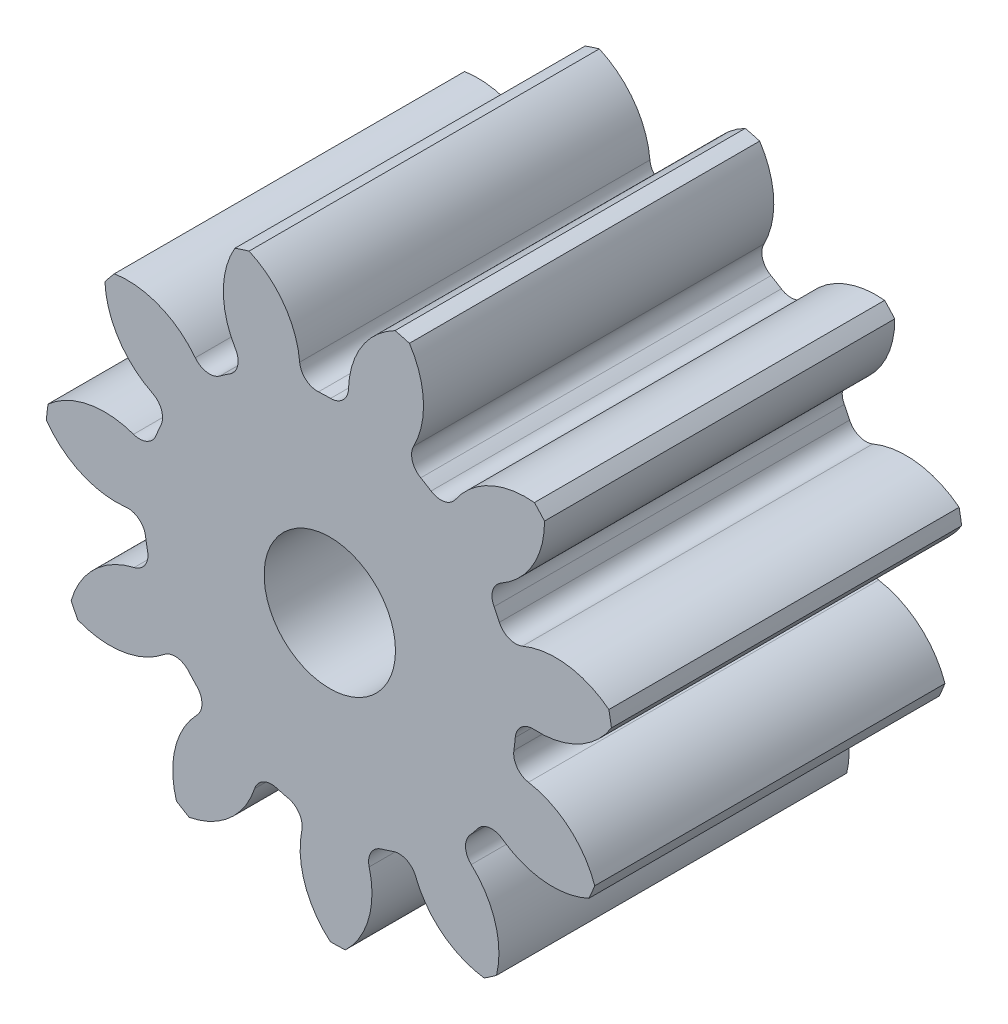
ISO-10303-21;
HEADER;
FILE_DESCRIPTION(('STEP AP214'),'2;1');
FILE_NAME('part.step','',(''),(''),'','','');
FILE_SCHEMA(('AUTOMOTIVE_DESIGN { 1 0 10303 214 1 1 1 1 }'));
ENDSEC;
DATA;
#1=APPLICATION_CONTEXT('core data for automotive mechanical design processes');
#2=APPLICATION_PROTOCOL_DEFINITION('international standard','automotive_design',2000,#1);
#3=PRODUCT_CONTEXT('',#1,'mechanical');
#4=PRODUCT('Part','Part','',(#3));
#5=PRODUCT_RELATED_PRODUCT_CATEGORY('part','',(#4));
#6=PRODUCT_DEFINITION_FORMATION('','',#4);
#7=PRODUCT_DEFINITION_CONTEXT('part definition',#1,'design');
#8=PRODUCT_DEFINITION('design','',#6,#7);
#9=PRODUCT_DEFINITION_SHAPE('','',#8);
#10=(LENGTH_UNIT() NAMED_UNIT(*) SI_UNIT(.MILLI.,.METRE.));
#11=(NAMED_UNIT(*) PLANE_ANGLE_UNIT() SI_UNIT($,.RADIAN.));
#12=(NAMED_UNIT(*) SI_UNIT($,.STERADIAN.) SOLID_ANGLE_UNIT());
#13=UNCERTAINTY_MEASURE_WITH_UNIT(LENGTH_MEASURE(1.E-05),#10,'distance_accuracy_value','');
#14=(GEOMETRIC_REPRESENTATION_CONTEXT(3) GLOBAL_UNCERTAINTY_ASSIGNED_CONTEXT((#13)) GLOBAL_UNIT_ASSIGNED_CONTEXT((#10,
#11,#12)) REPRESENTATION_CONTEXT('',''));
#15=CARTESIAN_POINT('',(0.,0.,0.));
#16=DIRECTION('',(0.,0.,1.));
#17=DIRECTION('',(1.,0.,0.));
#18=AXIS2_PLACEMENT_3D('',#15,#16,#17);
#19=CARTESIAN_POINT('',(0.,0.,101.6));
#20=DIRECTION('',(0.,0.,-1.));
#21=DIRECTION('',(-1.,0.,0.));
#22=AXIS2_PLACEMENT_3D('',#19,#20,#21);
#23=CYLINDRICAL_SURFACE('',#22,82.55);
#24=DIRECTION('',(0.,0.,-1.));
#25=VECTOR('',#24,1.);
#26=CARTESIAN_POINT('',(80.9486356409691,16.180880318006,50.8));
#27=LINE('',#26,#25);
#28=CARTESIAN_POINT('',(80.9486356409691,16.180880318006,101.6));
#29=VERTEX_POINT('',#28);
#30=CARTESIAN_POINT('',(80.9486356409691,16.180880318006,0.));
#31=VERTEX_POINT('',#30);
#32=EDGE_CURVE('E492',#29,#31,#27,.T.);
#33=ORIENTED_EDGE('',*,*,#32,.F.);
#34=CARTESIAN_POINT('',(0.,0.,101.6));
#35=DIRECTION('',(0.,0.,1.));
#36=DIRECTION('',(1.,0.,0.));
#37=AXIS2_PLACEMENT_3D('',#34,#35,#36);
#38=CIRCLE('',#37,82.55);
#39=CARTESIAN_POINT('',(81.6854616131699,11.9158659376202,101.6));
#40=VERTEX_POINT('',#39);
#41=EDGE_CURVE('E871',#40,#29,#38,.T.);
#42=ORIENTED_EDGE('',*,*,#41,.F.);
#43=DIRECTION('',(0.,0.,-1.));
#44=VECTOR('',#43,1.);
#45=CARTESIAN_POINT('',(81.6854616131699,11.9158659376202,50.8));
#46=LINE('',#45,#44);
#47=CARTESIAN_POINT('',(81.6854616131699,11.9158659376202,0.));
#48=VERTEX_POINT('',#47);
#49=EDGE_CURVE('E865',#48,#40,#46,.F.);
#50=ORIENTED_EDGE('',*,*,#49,.F.);
#51=CARTESIAN_POINT('',(0.,0.,0.));
#52=DIRECTION('',(0.,0.,1.));
#53=DIRECTION('',(1.,0.,0.));
#54=AXIS2_PLACEMENT_3D('',#51,#52,#53);
#55=CIRCLE('',#54,82.55);
#56=EDGE_CURVE('E876',#48,#31,#55,.T.);
#57=ORIENTED_EDGE('',*,*,#56,.T.);
#58=EDGE_LOOP('',(#33,#42,#50,#57));
#59=FACE_BOUND('',#58,.T.);
#60=ADVANCED_FACE('F33',(#59),#23,.T.);
#61=DIRECTION('',(0.,0.,-1.));
#62=VECTOR('',#61,1.);
#63=CARTESIAN_POINT('',(62.2759796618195,54.1867590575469,50.8));
#64=LINE('',#63,#62);
#65=CARTESIAN_POINT('',(62.2759796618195,54.1867590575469,0.));
#66=VERTEX_POINT('',#65);
#67=CARTESIAN_POINT('',(62.2759796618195,54.1867590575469,101.6));
#68=VERTEX_POINT('',#67);
#69=EDGE_CURVE('E463',#66,#68,#64,.F.);
#70=ORIENTED_EDGE('',*,*,#69,.F.);
#71=CARTESIAN_POINT('',(59.3502813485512,57.37635927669,0.));
#72=VERTEX_POINT('',#71);
#73=EDGE_CURVE('E879',#66,#72,#55,.T.);
#74=ORIENTED_EDGE('',*,*,#73,.T.);
#75=DIRECTION('',(0.,0.,-1.));
#76=VECTOR('',#75,1.);
#77=CARTESIAN_POINT('',(59.3502813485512,57.37635927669,50.8));
#78=LINE('',#77,#76);
#79=CARTESIAN_POINT('',(59.3502813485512,57.37635927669,101.6));
#80=VERTEX_POINT('',#79);
#81=EDGE_CURVE('E525',#80,#72,#78,.T.);
#82=ORIENTED_EDGE('',*,*,#81,.F.);
#83=EDGE_CURVE('E874',#68,#80,#38,.T.);
#84=ORIENTED_EDGE('',*,*,#83,.F.);
#85=EDGE_LOOP('',(#70,#74,#82,#84));
#86=FACE_BOUND('',#85,.T.);
#87=ADVANCED_FACE('F1006',(#86),#23,.T.);
#88=CARTESIAN_POINT('',(0.,0.,101.6));
#89=DIRECTION('',(0.,0.,1.));
#90=DIRECTION('',(1.,0.,0.));
#91=AXIS2_PLACEMENT_3D('',#88,#89,#90);
#92=PLANE('',#91);
#93=CARTESIAN_POINT('',(0.,0.,101.599999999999));
#94=DIRECTION('',(0.,0.,1.));
#95=DIRECTION('',(1.,0.,0.));
#96=AXIS2_PLACEMENT_3D('',#93,#94,#95);
#97=CIRCLE('',#96,19.05);
#98=CARTESIAN_POINT('',(19.05,0.,101.599999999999));
#99=VERTEX_POINT('',#98);
#100=EDGE_CURVE('E480',#99,#99,#97,.T.);
#101=ORIENTED_EDGE('',*,*,#100,.F.);
#102=EDGE_LOOP('',(#101));
#103=FACE_BOUND('',#102,.T.);
#104=ORIENTED_EDGE('',*,*,#41,.T.);
#105=CARTESIAN_POINT('',(65.5536679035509,-3.31691292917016,101.6));
#106=DIRECTION('',(0.,0.,-1.));
#107=DIRECTION('',(0.841253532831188,0.540640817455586,0.));
#108=AXIS2_PLACEMENT_3D('',#105,#106,#107);
#109=CIRCLE('',#108,24.8428857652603);
#110=CARTESIAN_POINT('',(55.9094231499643,19.5775736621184,101.6));
#111=VERTEX_POINT('',#110);
#112=EDGE_CURVE('E472',#111,#29,#109,.T.);
#113=ORIENTED_EDGE('',*,*,#112,.F.);
#114=CARTESIAN_POINT('',(53.9028069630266,24.3410827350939,101.6));
#115=DIRECTION('',(0.,0.,1.));
#116=DIRECTION('',(-0.841253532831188,-0.540640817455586,0.));
#117=AXIS2_PLACEMENT_3D('',#114,#115,#116);
#118=CIRCLE('',#117,5.1689);
#119=CARTESIAN_POINT('',(49.1919539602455,22.2137860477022,101.6));
#120=VERTEX_POINT('',#119);
#121=EDGE_CURVE('E470',#120,#111,#118,.T.);
#122=ORIENTED_EDGE('',*,*,#121,.F.);
#123=CARTESIAN_POINT('',(0.,0.,101.6));
#124=DIRECTION('',(0.,0.,-1.));
#125=DIRECTION('',(0.841253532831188,0.540640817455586,0.));
#126=AXIS2_PLACEMENT_3D('',#123,#124,#125);
#127=CIRCLE('',#126,53.975);
#128=CARTESIAN_POINT('',(47.6447121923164,25.363005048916,101.6));
#129=VERTEX_POINT('',#128);
#130=EDGE_CURVE('E455',#129,#120,#127,.T.);
#131=ORIENTED_EDGE('',*,*,#130,.F.);
#132=CARTESIAN_POINT('',(52.2073940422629,27.7918857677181,101.6));
#133=DIRECTION('',(0.,0.,1.));
#134=DIRECTION('',(-0.841253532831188,-0.540640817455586,0.));
#135=AXIS2_PLACEMENT_3D('',#132,#133,#134);
#136=CIRCLE('',#135,5.1689);
#137=CARTESIAN_POINT('',(49.6630851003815,32.2912211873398,101.6));
#138=VERTEX_POINT('',#137);
#139=EDGE_CURVE('E447',#138,#129,#136,.T.);
#140=ORIENTED_EDGE('',*,*,#139,.F.);
#141=CARTESIAN_POINT('',(37.4345690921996,53.9160303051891,101.6));
#142=DIRECTION('',(0.,0.,-1.));
#143=DIRECTION('',(-0.841253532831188,-0.540640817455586,0.));
#144=AXIS2_PLACEMENT_3D('',#141,#142,#143);
#145=CIRCLE('',#144,24.8428857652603);
#146=EDGE_CURVE('E477',#68,#138,#145,.T.);
#147=ORIENTED_EDGE('',*,*,#146,.F.);
#148=ORIENTED_EDGE('',*,*,#83,.T.);
#149=CARTESIAN_POINT('',(56.9405132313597,32.6506238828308,101.6));
#150=DIRECTION('',(0.,0.,-1.));
#151=DIRECTION('',(0.415415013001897,0.909631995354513,0.));
#152=AXIS2_PLACEMENT_3D('',#149,#150,#151);
#153=CIRCLE('',#152,24.8428857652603);
#154=CARTESIAN_POINT('',(36.4495643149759,46.6966192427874,101.6));
#155=VERTEX_POINT('',#154);
#156=EDGE_CURVE('E501',#155,#80,#153,.T.);
#157=ORIENTED_EDGE('',*,*,#156,.F.);
#158=CARTESIAN_POINT('',(32.1861439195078,49.6190794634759,101.6));
#159=DIRECTION('',(0.,0.,1.));
#160=DIRECTION('',(-0.415415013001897,-0.909631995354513,0.));
#161=AXIS2_PLACEMENT_3D('',#158,#159,#160);
#162=CIRCLE('',#161,5.1689);
#163=CARTESIAN_POINT('',(29.3732256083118,45.2826041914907,101.6));
#164=VERTEX_POINT('',#163);
#165=EDGE_CURVE('E499',#164,#155,#162,.T.);
#166=ORIENTED_EDGE('',*,*,#165,.F.);
#167=CARTESIAN_POINT('',(0.,0.,101.6));
#168=DIRECTION('',(0.,0.,-1.));
#169=DIRECTION('',(0.415415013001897,0.909631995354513,0.));
#170=AXIS2_PLACEMENT_3D('',#167,#168,#169);
#171=CIRCLE('',#170,53.975);
#172=CARTESIAN_POINT('',(26.3690066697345,47.0953937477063,101.6));
#173=VERTEX_POINT('',#172);
#174=EDGE_CURVE('E496',#173,#164,#171,.T.);
#175=ORIENTED_EDGE('',*,*,#174,.F.);
#176=CARTESIAN_POINT('',(28.8942268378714,51.605470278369,101.6));
#177=DIRECTION('',(0.,0.,1.));
#178=DIRECTION('',(-0.415415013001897,-0.909631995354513,0.));
#179=AXIS2_PLACEMENT_3D('',#176,#177,#178);
#180=CIRCLE('',#179,5.1689);
#181=CARTESIAN_POINT('',(24.3212935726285,54.0149948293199,101.6));
#182=VERTEX_POINT('',#181);
#183=EDGE_CURVE('E494',#182,#173,#180,.T.);
#184=ORIENTED_EDGE('',*,*,#183,.F.);
#185=CARTESIAN_POINT('',(2.3427568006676,65.5957070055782,101.6));
#186=DIRECTION('',(0.,0.,-1.));
#187=DIRECTION('',(-0.415415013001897,-0.909631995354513,0.));
#188=AXIS2_PLACEMENT_3D('',#185,#186,#187);
#189=CIRCLE('',#188,24.8428857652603);
#190=CARTESIAN_POINT('',(23.0943141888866,79.2537390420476,101.6));
#191=VERTEX_POINT('',#190);
#192=EDGE_CURVE('E504',#191,#182,#189,.T.);
#193=ORIENTED_EDGE('',*,*,#192,.F.);
#194=CARTESIAN_POINT('',(18.9086320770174,80.355249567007,101.6));
#195=VERTEX_POINT('',#194);
#196=EDGE_CURVE('E909',#191,#195,#38,.T.);
#197=ORIENTED_EDGE('',*,*,#196,.T.);
#198=CARTESIAN_POINT('',(30.249147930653,58.2518183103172,101.6));
#199=DIRECTION('',(0.,0.,-1.));
#200=DIRECTION('',(-0.142314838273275,0.989821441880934,0.));
#201=AXIS2_PLACEMENT_3D('',#198,#199,#200);
#202=CIRCLE('',#201,24.8428857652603);
#203=CARTESIAN_POINT('',(5.41722635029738,58.9898181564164,101.6));
#204=VERTEX_POINT('',#203);
#205=EDGE_CURVE('E536',#204,#195,#202,.T.);
#206=ORIENTED_EDGE('',*,*,#205,.F.);
#207=CARTESIAN_POINT('',(0.250607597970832,59.1433690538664,101.6));
#208=DIRECTION('',(0.,0.,1.));
#209=DIRECTION('',(0.142314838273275,-0.989821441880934,0.));
#210=AXIS2_PLACEMENT_3D('',#207,#208,#209);
#211=CIRCLE('',#210,5.1689);
#212=CARTESIAN_POINT('',(0.228705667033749,53.974515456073,101.6));
#213=VERTEX_POINT('',#212);
#214=EDGE_CURVE('E534',#213,#204,#211,.T.);
#215=ORIENTED_EDGE('',*,*,#214,.F.);
#216=CARTESIAN_POINT('',(0.,0.,101.6));
#217=DIRECTION('',(0.,0.,-1.));
#218=DIRECTION('',(-0.142314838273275,0.989821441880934,0.));
#219=AXIS2_PLACEMENT_3D('',#216,#217,#218);
#220=CIRCLE('',#219,53.975);
#221=CARTESIAN_POINT('',(-3.27867215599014,53.8753276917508,101.6));
#222=VERTEX_POINT('',#221);
#223=EDGE_CURVE('E531',#222,#213,#220,.T.);
#224=ORIENTED_EDGE('',*,*,#223,.F.);
#225=CARTESIAN_POINT('',(-3.59265323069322,59.0346826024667,101.6));
#226=DIRECTION('',(0.,0.,1.));
#227=DIRECTION('',(0.142314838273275,-0.989821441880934,0.));
#228=AXIS2_PLACEMENT_3D('',#225,#226,#227);
#229=CIRCLE('',#228,5.1689);
#230=CARTESIAN_POINT('',(-8.74233681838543,58.5893892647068,101.6));
#231=VERTEX_POINT('',#230);
#232=EDGE_CURVE('E529',#231,#222,#229,.T.);
#233=ORIENTED_EDGE('',*,*,#232,.F.);
#234=CARTESIAN_POINT('',(-33.4928642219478,56.4492102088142,101.6));
#235=DIRECTION('',(0.,0.,-1.));
#236=DIRECTION('',(0.142314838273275,-0.989821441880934,0.));
#237=AXIS2_PLACEMENT_3D('',#234,#235,#236);
#238=CIRCLE('',#237,24.8428857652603);
#239=CARTESIAN_POINT('',(-23.4196328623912,79.1582168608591,101.6));
#240=VERTEX_POINT('',#239);
#241=EDGE_CURVE('E539',#240,#231,#238,.T.);
#242=ORIENTED_EDGE('',*,*,#241,.F.);
#243=CARTESIAN_POINT('',(-27.5363742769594,77.8219158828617,101.6));
#244=VERTEX_POINT('',#243);
#245=EDGE_CURVE('E988',#240,#244,#38,.T.);
#246=ORIENTED_EDGE('',*,*,#245,.T.);
#247=CARTESIAN_POINT('',(-6.04610810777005,65.3584720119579,101.6));
#248=DIRECTION('',(0.,0.,-1.));
#249=DIRECTION('',(-0.654860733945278,0.755749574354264,0.));
#250=AXIS2_PLACEMENT_3D('',#247,#248,#249);
#251=CIRCLE('',#250,24.8428857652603);
#252=CARTESIAN_POINT('',(-27.3350427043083,52.554166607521,101.6));
#253=VERTEX_POINT('',#252);
#254=EDGE_CURVE('E574',#253,#244,#251,.T.);
#255=ORIENTED_EDGE('',*,*,#254,.F.);
#256=CARTESIAN_POINT('',(-31.7644948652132,49.8900568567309,101.6));
#257=DIRECTION('',(0.,0.,1.));
#258=DIRECTION('',(0.654860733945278,-0.755749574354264,0.));
#259=AXIS2_PLACEMENT_3D('',#256,#257,#258);
#260=CIRCLE('',#259,5.1689);
#261=CARTESIAN_POINT('',(-28.9884267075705,45.5298994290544,101.6));
#262=VERTEX_POINT('',#261);
#263=EDGE_CURVE('E572',#262,#253,#260,.T.);
#264=ORIENTED_EDGE('',*,*,#263,.F.);
#265=CARTESIAN_POINT('',(0.,0.,101.6));
#266=DIRECTION('',(0.,0.,-1.));
#267=DIRECTION('',(-0.654860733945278,0.755749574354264,0.));
#268=AXIS2_PLACEMENT_3D('',#265,#266,#267);
#269=CIRCLE('',#268,53.975);
#270=CARTESIAN_POINT('',(-31.8853957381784,43.5502257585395,101.6));
#271=VERTEX_POINT('',#270);
#272=EDGE_CURVE('E569',#271,#262,#269,.T.);
#273=ORIENTED_EDGE('',*,*,#272,.F.);
#274=CARTESIAN_POINT('',(-34.9388912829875,47.7208003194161,101.6));
#275=DIRECTION('',(0.,0.,1.));
#276=DIRECTION('',(0.654860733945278,-0.755749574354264,0.));
#277=AXIS2_PLACEMENT_3D('',#274,#275,#276);
#278=CIRCLE('',#277,5.1689);
#279=CARTESIAN_POINT('',(-39.0303370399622,44.5620665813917,101.6));
#280=VERTEX_POINT('',#279);
#281=EDGE_CURVE('E567',#280,#271,#278,.T.);
#282=ORIENTED_EDGE('',*,*,#281,.F.);
#283=CARTESIAN_POINT('',(-58.6947375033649,29.3804880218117,101.6));
#284=DIRECTION('',(0.,0.,-1.));
#285=DIRECTION('',(0.654860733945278,-0.755749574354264,0.));
#286=AXIS2_PLACEMENT_3D('',#283,#284,#285);
#287=CIRCLE('',#286,24.8428857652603);
#288=CARTESIAN_POINT('',(-62.4980119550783,53.9305201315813,101.6));
#289=VERTEX_POINT('',#288);
#290=EDGE_CURVE('E577',#289,#280,#287,.T.);
#291=ORIENTED_EDGE('',*,*,#290,.F.);
#292=CARTESIAN_POINT('',(-65.238776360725,50.5806737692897,101.6));
#293=VERTEX_POINT('',#292);
#294=EDGE_CURVE('E984',#289,#293,#38,.T.);
#295=ORIENTED_EDGE('',*,*,#294,.T.);
#296=CARTESIAN_POINT('',(-40.4217675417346,51.7142726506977,101.6));
#297=DIRECTION('',(0.,0.,-1.));
#298=DIRECTION('',(-0.959492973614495,0.281732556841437,0.));
#299=AXIS2_PLACEMENT_3D('',#296,#297,#298);
#300=CIRCLE('',#299,24.8428857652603);
#301=CARTESIAN_POINT('',(-51.4086288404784,29.4329384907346,101.6));
#302=VERTEX_POINT('',#301);
#303=EDGE_CURVE('E612',#302,#293,#300,.T.);
#304=ORIENTED_EDGE('',*,*,#303,.F.);
#305=CARTESIAN_POINT('',(-53.6945946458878,24.7970041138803,101.6));
#306=DIRECTION('',(0.,0.,1.));
#307=DIRECTION('',(0.959492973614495,-0.281732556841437,0.));
#308=AXIS2_PLACEMENT_3D('',#305,#306,#307);
#309=CIRCLE('',#308,5.1689);
#310=CARTESIAN_POINT('',(-49.0019384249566,22.6298620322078,101.6));
#311=VERTEX_POINT('',#310);
#312=EDGE_CURVE('E610',#311,#302,#309,.T.);
#313=ORIENTED_EDGE('',*,*,#312,.F.);
#314=CARTESIAN_POINT('',(0.,0.,101.6));
#315=DIRECTION('',(0.,0.,-1.));
#316=DIRECTION('',(-0.959492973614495,0.281732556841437,0.));
#317=AXIS2_PLACEMENT_3D('',#314,#315,#316);
#318=CIRCLE('',#317,53.975);
#319=CARTESIAN_POINT('',(-50.3687314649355,19.3982348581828,101.6));
#320=VERTEX_POINT('',#319);
#321=EDGE_CURVE('E607',#320,#311,#318,.T.);
#322=ORIENTED_EDGE('',*,*,#321,.F.);
#323=CARTESIAN_POINT('',(-55.1922782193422,21.2559011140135,101.6));
#324=DIRECTION('',(0.,0.,1.));
#325=DIRECTION('',(0.959492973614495,-0.281732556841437,0.));
#326=AXIS2_PLACEMENT_3D('',#323,#324,#325);
#327=CIRCLE('',#326,5.1689);
#328=CARTESIAN_POINT('',(-56.9264810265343,16.3866026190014,101.6));
#329=VERTEX_POINT('',#328);
#330=EDGE_CURVE('E605',#329,#320,#327,.T.);
#331=ORIENTED_EDGE('',*,*,#330,.F.);
#332=CARTESIAN_POINT('',(-65.2614463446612,-7.01633151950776,101.6));
#333=DIRECTION('',(0.,0.,-1.));
#334=DIRECTION('',(0.959492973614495,-0.281732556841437,0.));
#335=AXIS2_PLACEMENT_3D('',#332,#333,#334);
#336=CIRCLE('',#335,24.8428857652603);
#337=CARTESIAN_POINT('',(-81.7337138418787,11.5802643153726,101.6));
#338=VERTEX_POINT('',#337);
#339=EDGE_CURVE('E615',#338,#329,#336,.T.);
#340=ORIENTED_EDGE('',*,*,#339,.F.);
#341=CARTESIAN_POINT('',(-82.2283279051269,7.28042511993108,101.6));
#342=VERTEX_POINT('',#341);
#343=EDGE_CURVE('E980',#338,#342,#38,.T.);
#344=ORIENTED_EDGE('',*,*,#343,.T.);
#345=CARTESIAN_POINT('',(-61.9638013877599,21.6511571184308,101.6));
#346=DIRECTION('',(0.,0.,-1.));
#347=DIRECTION('',(-0.959492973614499,-0.281732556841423,0.));
#348=AXIS2_PLACEMENT_3D('',#345,#346,#347);
#349=CIRCLE('',#348,24.8428857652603);
#350=CARTESIAN_POINT('',(-59.1603385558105,-3.03303963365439,101.6));
#351=VERTEX_POINT('',#350);
#352=EDGE_CURVE('E650',#351,#342,#349,.T.);
#353=ORIENTED_EDGE('',*,*,#352,.F.);
#354=CARTESIAN_POINT('',(-58.5770400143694,-8.16892222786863,101.6));
#355=DIRECTION('',(0.,0.,1.));
#356=DIRECTION('',(0.959492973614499,0.281732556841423,0.));
#357=AXIS2_PLACEMENT_3D('',#354,#355,#356);
#358=CIRCLE('',#357,5.1689);
#359=CARTESIAN_POINT('',(-53.457680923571,-7.45499666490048,101.6));
#360=VERTEX_POINT('',#359);
#361=EDGE_CURVE('E648',#360,#351,#358,.T.);
#362=ORIENTED_EDGE('',*,*,#361,.F.);
#363=CARTESIAN_POINT('',(0.,0.,101.6));
#364=DIRECTION('',(0.,0.,-1.));
#365=DIRECTION('',(-0.959492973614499,-0.281732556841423,0.));
#366=AXIS2_PLACEMENT_3D('',#363,#364,#365);
#367=CIRCLE('',#366,53.975);
#368=CARTESIAN_POINT('',(-52.8603508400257,-10.912558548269,101.6));
#369=VERTEX_POINT('',#368);
#370=EDGE_CURVE('E645',#369,#360,#367,.T.);
#371=ORIENTED_EDGE('',*,*,#370,.F.);
#372=CARTESIAN_POINT('',(-57.9225067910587,-11.957596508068,101.6));
#373=DIRECTION('',(0.,0.,1.));
#374=DIRECTION('',(0.959492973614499,0.281732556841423,0.));
#375=AXIS2_PLACEMENT_3D('',#372,#373,#374);
#376=CIRCLE('',#375,5.1689);
#377=CARTESIAN_POINT('',(-56.7488695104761,-16.9914918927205,101.6));
#378=VERTEX_POINT('',#377);
#379=EDGE_CURVE('E643',#378,#369,#376,.T.);
#380=ORIENTED_EDGE('',*,*,#379,.F.);
#381=CARTESIAN_POINT('',(-51.1081070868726,-41.185515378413,101.6));
#382=DIRECTION('',(0.,0.,-1.));
#383=DIRECTION('',(0.959492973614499,0.281732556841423,0.));
#384=AXIS2_PLACEMENT_3D('',#381,#382,#383);
#385=CIRCLE('',#384,24.8428857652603);
#386=CARTESIAN_POINT('',(-75.0195390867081,-34.4466435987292,101.6));
#387=VERTEX_POINT('',#386);
#388=EDGE_CURVE('E653',#387,#378,#385,.T.);
#389=ORIENTED_EDGE('',*,*,#388,.F.);
#390=CARTESIAN_POINT('',(-73.1109663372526,-38.33130706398,101.6));
#391=VERTEX_POINT('',#390);
#392=EDGE_CURVE('E976',#387,#391,#38,.T.);
#393=ORIENTED_EDGE('',*,*,#392,.T.);
#394=CARTESIAN_POINT('',(-63.8327661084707,-15.286047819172,101.6));
#395=DIRECTION('',(0.,0.,-1.));
#396=DIRECTION('',(-0.654860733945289,-0.755749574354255,0.));
#397=AXIS2_PLACEMENT_3D('',#394,#395,#396);
#398=CIRCLE('',#397,24.8428857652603);
#399=CARTESIAN_POINT('',(-48.1290587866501,-34.5360491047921,101.6));
#400=VERTEX_POINT('',#399);
#401=EDGE_CURVE('E688',#400,#391,#398,.T.);
#402=ORIENTED_EDGE('',*,*,#401,.F.);
#403=CARTESIAN_POINT('',(-44.8616890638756,-38.5412734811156,101.6));
#404=DIRECTION('',(0.,0.,1.));
#405=DIRECTION('',(0.654860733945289,0.755749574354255,0.));
#406=AXIS2_PLACEMENT_3D('',#403,#404,#405);
#407=CIRCLE('',#406,5.1689);
#408=CARTESIAN_POINT('',(-40.9409874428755,-35.1729465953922,101.6));
#409=VERTEX_POINT('',#408);
#410=EDGE_CURVE('E686',#409,#400,#407,.T.);
#411=ORIENTED_EDGE('',*,*,#410,.F.);
#412=CARTESIAN_POINT('',(0.,0.,101.6));
#413=DIRECTION('',(0.,0.,-1.));
#414=DIRECTION('',(-0.654860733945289,-0.755749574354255,0.));
#415=AXIS2_PLACEMENT_3D('',#412,#413,#414);
#416=CIRCLE('',#415,53.975);
#417=CARTESIAN_POINT('',(-38.569182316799,-37.7586917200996,101.6));
#418=VERTEX_POINT('',#417);
#419=EDGE_CURVE('E683',#418,#409,#416,.T.);
#420=ORIENTED_EDGE('',*,*,#419,.F.);
#421=CARTESIAN_POINT('',(-42.2627487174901,-41.3746417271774,101.6));
#422=DIRECTION('',(0.,0.,1.));
#423=DIRECTION('',(0.654860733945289,0.755749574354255,0.));
#424=AXIS2_PLACEMENT_3D('',#421,#422,#423);
#425=CIRCLE('',#424,5.1689);
#426=CARTESIAN_POINT('',(-38.5538928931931,-44.9749077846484,101.6));
#427=VERTEX_POINT('',#426);
#428=EDGE_CURVE('E681',#427,#418,#425,.T.);
#429=ORIENTED_EDGE('',*,*,#428,.F.);
#430=CARTESIAN_POINT('',(-20.7283049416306,-62.2785891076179,101.6));
#431=DIRECTION('',(0.,0.,-1.));
#432=DIRECTION('',(0.654860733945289,0.755749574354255,0.));
#433=AXIS2_PLACEMENT_3D('',#430,#431,#432);
#434=CIRCLE('',#433,24.8428857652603);
#435=CARTESIAN_POINT('',(-44.4871907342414,-69.5369855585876,101.6));
#436=VERTEX_POINT('',#435);
#437=EDGE_CURVE('E691',#436,#427,#434,.T.);
#438=ORIENTED_EDGE('',*,*,#437,.F.);
#439=CARTESIAN_POINT('',(-40.7813895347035,-71.7731200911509,101.6));
#440=VERTEX_POINT('',#439);
#441=EDGE_CURVE('E972',#436,#440,#38,.T.);
#442=ORIENTED_EDGE('',*,*,#441,.T.);
#443=CARTESIAN_POINT('',(-45.4352786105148,-47.3700405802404,101.6));
#444=DIRECTION('',(0.,0.,-1.));
#445=DIRECTION('',(-0.142314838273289,-0.989821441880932,0.));
#446=AXIS2_PLACEMENT_3D('',#443,#444,#445);
#447=CIRCLE('',#446,24.8428857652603);
#448=CARTESIAN_POINT('',(-21.8171429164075,-55.0741070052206,101.6));
#449=VERTEX_POINT('',#448);
#450=EDGE_CURVE('E726',#449,#440,#447,.T.);
#451=ORIENTED_EDGE('',*,*,#450,.F.);
#452=CARTESIAN_POINT('',(-16.9030688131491,-56.6770427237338,101.6));
#453=DIRECTION('',(0.,0.,1.));
#454=DIRECTION('',(0.142314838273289,0.989821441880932,0.));
#455=AXIS2_PLACEMENT_3D('',#452,#453,#454);
#456=CIRCLE('',#455,5.1689);
#457=CARTESIAN_POINT('',(-15.4258197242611,-51.7237345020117,101.6));
#458=VERTEX_POINT('',#457);
#459=EDGE_CURVE('E724',#458,#449,#456,.T.);
#460=ORIENTED_EDGE('',*,*,#459,.F.);
#461=CARTESIAN_POINT('',(0.,0.,101.6));
#462=DIRECTION('',(0.,0.,-1.));
#463=DIRECTION('',(-0.142314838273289,-0.989821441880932,0.));
#464=AXIS2_PLACEMENT_3D('',#461,#462,#463);
#465=CIRCLE('',#464,53.975);
#466=CARTESIAN_POINT('',(-12.0325709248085,-52.6167070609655,101.6));
#467=VERTEX_POINT('',#466);
#468=EDGE_CURVE('E721',#467,#458,#465,.T.);
#469=ORIENTED_EDGE('',*,*,#468,.F.);
#470=CARTESIAN_POINT('',(-13.1848665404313,-57.6555305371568,101.6));
#471=DIRECTION('',(0.,0.,1.));
#472=DIRECTION('',(0.142314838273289,0.989821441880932,0.));
#473=AXIS2_PLACEMENT_3D('',#470,#471,#472);
#474=CIRCLE('',#473,5.1689);
#475=CARTESIAN_POINT('',(-8.11832769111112,-58.6791082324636,101.6));
#476=VERTEX_POINT('',#475);
#477=EDGE_CURVE('E719',#476,#467,#474,.T.);
#478=ORIENTED_EDGE('',*,*,#477,.F.);
#479=CARTESIAN_POINT('',(16.2325875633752,-63.5986508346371,101.6));
#480=DIRECTION('',(0.,0.,-1.));
#481=DIRECTION('',(0.142314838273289,0.989821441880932,0.));
#482=AXIS2_PLACEMENT_3D('',#479,#480,#481);
#483=CIRCLE('',#482,24.8428857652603);
#484=CARTESIAN_POINT('',(0.169526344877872,-82.549825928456,101.6));
#485=VERTEX_POINT('',#484);
#486=EDGE_CURVE('E729',#485,#476,#483,.T.);
#487=ORIENTED_EDGE('',*,*,#486,.F.);
#488=CARTESIAN_POINT('',(4.49599029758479,-82.4274746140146,101.6));
#489=VERTEX_POINT('',#488);
#490=EDGE_CURVE('E968',#485,#489,#38,.T.);
#491=ORIENTED_EDGE('',*,*,#490,.T.);
#492=CARTESIAN_POINT('',(-12.6124111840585,-64.4143801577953,101.6));
#493=DIRECTION('',(0.,0.,-1.));
#494=DIRECTION('',(0.415415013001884,-0.909631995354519,0.));
#495=AXIS2_PLACEMENT_3D('',#492,#493,#494);
#496=CIRCLE('',#495,24.8428857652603);
#497=CARTESIAN_POINT('',(11.421561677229,-58.1265250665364,101.6));
#498=VERTEX_POINT('',#497);
#499=EDGE_CURVE('E764',#498,#489,#496,.T.);
#500=ORIENTED_EDGE('',*,*,#499,.F.);
#501=CARTESIAN_POINT('',(16.4221563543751,-56.818251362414,101.6));
#502=DIRECTION('',(0.,0.,1.));
#503=DIRECTION('',(-0.415415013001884,0.909631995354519,0.));
#504=AXIS2_PLACEMENT_3D('',#501,#502,#503);
#505=CIRCLE('',#504,5.1689);
#506=CARTESIAN_POINT('',(14.9869367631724,-51.8526021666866,101.6));
#507=VERTEX_POINT('',#506);
#508=EDGE_CURVE('E762',#507,#498,#505,.T.);
#509=ORIENTED_EDGE('',*,*,#508,.F.);
#510=CARTESIAN_POINT('',(0.,0.,101.6));
#511=DIRECTION('',(0.,0.,-1.));
#512=DIRECTION('',(0.415415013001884,-0.909631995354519,0.));
#513=AXIS2_PLACEMENT_3D('',#510,#511,#512);
#514=CIRCLE('',#513,53.975);
#515=CARTESIAN_POINT('',(18.3242967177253,-50.7692896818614,101.6));
#516=VERTEX_POINT('',#515);
#517=EDGE_CURVE('E759',#516,#507,#514,.T.);
#518=ORIENTED_EDGE('',*,*,#517,.F.);
#519=CARTESIAN_POINT('',(20.0791176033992,-55.6311957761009,101.6));
#520=DIRECTION('',(0.,0.,1.));
#521=DIRECTION('',(-0.415415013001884,0.909631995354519,0.));
#522=AXIS2_PLACEMENT_3D('',#519,#520,#521);
#523=CIRCLE('',#522,5.1689);
#524=CARTESIAN_POINT('',(24.8947491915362,-53.7531064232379,101.6));
#525=VERTEX_POINT('',#524);
#526=EDGE_CURVE('E757',#525,#516,#523,.T.);
#527=ORIENTED_EDGE('',*,*,#526,.F.);
#528=CARTESIAN_POINT('',(48.0397482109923,-44.7265902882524,101.6));
#529=DIRECTION('',(0.,0.,-1.));
#530=DIRECTION('',(-0.415415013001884,0.909631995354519,0.));
#531=AXIS2_PLACEMENT_3D('',#528,#529,#530);
#532=CIRCLE('',#531,24.8428857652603);
#533=CARTESIAN_POINT('',(44.7724200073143,-69.3536798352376,101.6));
#534=VERTEX_POINT('',#533);
#535=EDGE_CURVE('E767',#534,#525,#532,.T.);
#536=ORIENTED_EDGE('',*,*,#535,.F.);
#537=CARTESIAN_POINT('',(48.3459249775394,-66.9116883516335,101.6));
#538=VERTEX_POINT('',#537);
#539=EDGE_CURVE('E967',#534,#538,#38,.T.);
#540=ORIENTED_EDGE('',*,*,#539,.T.);
#541=CARTESIAN_POINT('',(24.2148076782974,-61.0076091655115,101.6));
#542=DIRECTION('',(0.,0.,-1.));
#543=DIRECTION('',(0.841253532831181,-0.540640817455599,0.));
#544=AXIS2_PLACEMENT_3D('',#541,#542,#543);
#545=CIRCLE('',#544,24.8428857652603);
#546=CARTESIAN_POINT('',(41.0340011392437,-42.7241821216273,101.6));
#547=VERTEX_POINT('',#546);
#548=EDGE_CURVE('E802',#547,#538,#545,.T.);
#549=ORIENTED_EDGE('',*,*,#548,.F.);
#550=CARTESIAN_POINT('',(44.5334629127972,-38.9200666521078,101.6));
#551=DIRECTION('',(0.,0.,1.));
#552=DIRECTION('',(-0.841253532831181,0.540640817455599,0.));
#553=AXIS2_PLACEMENT_3D('',#550,#551,#552);
#554=CIRCLE('',#553,5.1689);
#555=CARTESIAN_POINT('',(40.6414467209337,-35.5186350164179,101.6));
#556=VERTEX_POINT('',#555);
#557=EDGE_CURVE('E800',#556,#547,#554,.T.);
#558=ORIENTED_EDGE('',*,*,#557,.F.);
#559=CARTESIAN_POINT('',(0.,0.,101.6));
#560=DIRECTION('',(0.,0.,-1.));
#561=DIRECTION('',(0.841253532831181,-0.540640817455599,0.));
#562=AXIS2_PLACEMENT_3D('',#559,#560,#561);
#563=CIRCLE('',#562,53.975);
#564=CARTESIAN_POINT('',(42.8633296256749,-32.8029815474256,101.6));
#565=VERTEX_POINT('',#564);
#566=EDGE_CURVE('E797',#565,#556,#563,.T.);
#567=ORIENTED_EDGE('',*,*,#566,.F.);
#568=CARTESIAN_POINT('',(46.968123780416,-35.944349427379,101.6));
#569=DIRECTION('',(0.,0.,1.));
#570=DIRECTION('',(-0.841253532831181,0.540640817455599,0.));
#571=AXIS2_PLACEMENT_3D('',#568,#569,#570);
#572=CIRCLE('',#571,5.1689);
#573=CARTESIAN_POINT('',(50.0039191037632,-31.7608731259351,101.6));
#574=VERTEX_POINT('',#573);
#575=EDGE_CURVE('E795',#574,#565,#572,.T.);
#576=ORIENTED_EDGE('',*,*,#575,.F.);
#577=CARTESIAN_POINT('',(64.5946282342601,-11.6541533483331,101.6));
#578=DIRECTION('',(0.,0.,-1.));
#579=DIRECTION('',(-0.841253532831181,0.540640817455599,0.));
#580=AXIS2_PLACEMENT_3D('',#577,#578,#579);
#581=CIRCLE('',#580,24.8428857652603);
#582=CARTESIAN_POINT('',(75.1603866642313,-34.1382304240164,101.6));
#583=VERTEX_POINT('',#582);
#584=EDGE_CURVE('E805',#583,#574,#581,.T.);
#585=ORIENTED_EDGE('',*,*,#584,.F.);
#586=CARTESIAN_POINT('',(76.8463700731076,-30.1519138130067,101.6));
#587=VERTEX_POINT('',#586);
#588=EDGE_CURVE('E875',#583,#587,#38,.T.);
#589=ORIENTED_EDGE('',*,*,#588,.T.);
#590=CARTESIAN_POINT('',(53.3539961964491,-38.2313533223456,101.6));
#591=DIRECTION('',(0.,0.,-1.));
#592=DIRECTION('',(1.,0.,0.));
#593=AXIS2_PLACEMENT_3D('',#590,#591,#592);
#594=CIRCLE('',#593,24.8428857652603);
#595=CARTESIAN_POINT('',(57.6184351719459,-13.757213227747,101.6));
#596=VERTEX_POINT('',#595);
#597=EDGE_CURVE('E840',#596,#587,#594,.T.);
#598=ORIENTED_EDGE('',*,*,#597,.F.);
#599=CARTESIAN_POINT('',(58.505709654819,-8.6650357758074,101.6));
#600=DIRECTION('',(0.,0.,1.));
#601=DIRECTION('',(-1.,0.,0.));
#602=AXIS2_PLACEMENT_3D('',#599,#600,#601);
#603=CIRCLE('',#602,5.1689);
#604=CARTESIAN_POINT('',(53.3925845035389,-7.90775221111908,101.6));
#605=VERTEX_POINT('',#604);
#606=EDGE_CURVE('E838',#605,#596,#603,.T.);
#607=ORIENTED_EDGE('',*,*,#606,.F.);
#608=CARTESIAN_POINT('',(0.,0.,101.6));
#609=DIRECTION('',(0.,0.,-1.));
#610=DIRECTION('',(1.,0.,0.));
#611=AXIS2_PLACEMENT_3D('',#608,#609,#610);
#612=CIRCLE('',#611,53.975);
#613=CARTESIAN_POINT('',(53.7935582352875,-4.42195854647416,101.6));
#614=VERTEX_POINT('',#613);
#615=EDGE_CURVE('E835',#614,#605,#612,.T.);
#616=ORIENTED_EDGE('',*,*,#615,.F.);
#617=CARTESIAN_POINT('',(58.945082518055,-4.8454261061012,101.6));
#618=DIRECTION('',(0.,0.,1.));
#619=DIRECTION('',(-1.,0.,0.));
#620=AXIS2_PLACEMENT_3D('',#617,#618,#619);
#621=CIRCLE('',#620,5.1689);
#622=CARTESIAN_POINT('',(59.2371980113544,0.315212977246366,101.6));
#623=VERTEX_POINT('',#622);
#624=EDGE_CURVE('E833',#623,#614,#621,.T.);
#625=ORIENTED_EDGE('',*,*,#624,.F.);
#626=CARTESIAN_POINT('',(60.6411701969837,25.1183949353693,101.6));
#627=DIRECTION('',(0.,0.,-1.));
#628=DIRECTION('',(-1.,0.,0.));
#629=AXIS2_PLACEMENT_3D('',#626,#627,#628);
#630=CIRCLE('',#629,24.8428857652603);
#631=EDGE_CURVE('E843',#40,#623,#630,.T.);
#632=ORIENTED_EDGE('',*,*,#631,.F.);
#633=EDGE_LOOP('',(#104,#113,#122,#131,#140,#147,#148,#157,#166,#175,#184,#193,#197,#206,#215,
#224,#233,#242,#246,#255,#264,#273,#282,#291,#295,#304,#313,#322,#331,#340,#344,#353,#362,#371,
#380,#389,#393,#402,#411,#420,#429,#438,#442,#451,#460,#469,#478,#487,#491,#500,#509,#518,#527,
#536,#540,#549,#558,#567,#576,#585,#589,#598,#607,#616,#625,#632));
#634=FACE_BOUND('',#633,.T.);
#635=ADVANCED_FACE('F468',(#103,#634),#92,.T.);
#636=CARTESIAN_POINT('',(0.,0.,0.));
#637=DIRECTION('',(0.,0.,1.));
#638=DIRECTION('',(1.,0.,0.));
#639=AXIS2_PLACEMENT_3D('',#636,#637,#638);
#640=PLANE('',#639);
#641=CARTESIAN_POINT('',(0.,0.,0.));
#642=DIRECTION('',(0.,0.,1.));
#643=DIRECTION('',(1.,0.,0.));
#644=AXIS2_PLACEMENT_3D('',#641,#642,#643);
#645=CIRCLE('',#644,19.05);
#646=CARTESIAN_POINT('',(19.05,0.,-1.77635683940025E-12));
#647=VERTEX_POINT('',#646);
#648=EDGE_CURVE('E36',#647,#647,#645,.T.);
#649=ORIENTED_EDGE('',*,*,#648,.T.);
#650=EDGE_LOOP('',(#649));
#651=FACE_BOUND('',#650,.T.);
#652=CARTESIAN_POINT('',(65.5536679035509,-3.31691292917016,0.));
#653=DIRECTION('',(0.,0.,-1.));
#654=DIRECTION('',(0.841253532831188,0.540640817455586,0.));
#655=AXIS2_PLACEMENT_3D('',#652,#653,#654);
#656=CIRCLE('',#655,24.8428857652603);
#657=CARTESIAN_POINT('',(55.9094231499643,19.5775736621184,0.));
#658=VERTEX_POINT('',#657);
#659=EDGE_CURVE('E456',#658,#31,#656,.T.);
#660=ORIENTED_EDGE('',*,*,#659,.T.);
#661=ORIENTED_EDGE('',*,*,#56,.F.);
#662=CARTESIAN_POINT('',(60.6411701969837,25.1183949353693,0.));
#663=DIRECTION('',(0.,0.,1.));
#664=DIRECTION('',(1.,0.,0.));
#665=AXIS2_PLACEMENT_3D('',#662,#663,#664);
#666=CIRCLE('',#665,24.8428857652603);
#667=CARTESIAN_POINT('',(59.2371980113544,0.315212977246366,0.));
#668=VERTEX_POINT('',#667);
#669=EDGE_CURVE('E873',#668,#48,#666,.T.);
#670=ORIENTED_EDGE('',*,*,#669,.F.);
#671=CARTESIAN_POINT('',(58.945082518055,-4.8454261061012,0.));
#672=DIRECTION('',(0.,0.,1.));
#673=DIRECTION('',(-1.,0.,0.));
#674=AXIS2_PLACEMENT_3D('',#671,#672,#673);
#675=CIRCLE('',#674,5.1689);
#676=CARTESIAN_POINT('',(53.7935582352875,-4.42195854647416,0.));
#677=VERTEX_POINT('',#676);
#678=EDGE_CURVE('E832',#668,#677,#675,.T.);
#679=ORIENTED_EDGE('',*,*,#678,.T.);
#680=CARTESIAN_POINT('',(0.,0.,0.));
#681=DIRECTION('',(0.,0.,-1.));
#682=DIRECTION('',(1.,0.,0.));
#683=AXIS2_PLACEMENT_3D('',#680,#681,#682);
#684=CIRCLE('',#683,53.975);
#685=CARTESIAN_POINT('',(53.3925845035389,-7.90775221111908,0.));
#686=VERTEX_POINT('',#685);
#687=EDGE_CURVE('E848',#677,#686,#684,.T.);
#688=ORIENTED_EDGE('',*,*,#687,.T.);
#689=CARTESIAN_POINT('',(58.505709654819,-8.6650357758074,0.));
#690=DIRECTION('',(0.,0.,1.));
#691=DIRECTION('',(-1.,0.,0.));
#692=AXIS2_PLACEMENT_3D('',#689,#690,#691);
#693=CIRCLE('',#692,5.1689);
#694=CARTESIAN_POINT('',(57.6184351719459,-13.757213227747,0.));
#695=VERTEX_POINT('',#694);
#696=EDGE_CURVE('E851',#686,#695,#693,.T.);
#697=ORIENTED_EDGE('',*,*,#696,.T.);
#698=CARTESIAN_POINT('',(53.3539961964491,-38.2313533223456,0.));
#699=DIRECTION('',(0.,0.,-1.));
#700=DIRECTION('',(1.,0.,0.));
#701=AXIS2_PLACEMENT_3D('',#698,#699,#700);
#702=CIRCLE('',#701,24.8428857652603);
#703=CARTESIAN_POINT('',(76.8463700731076,-30.1519138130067,0.));
#704=VERTEX_POINT('',#703);
#705=EDGE_CURVE('E836',#695,#704,#702,.T.);
#706=ORIENTED_EDGE('',*,*,#705,.T.);
#707=CARTESIAN_POINT('',(75.1603866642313,-34.1382304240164,0.));
#708=VERTEX_POINT('',#707);
#709=EDGE_CURVE('E870',#708,#704,#55,.T.);
#710=ORIENTED_EDGE('',*,*,#709,.F.);
#711=CARTESIAN_POINT('',(64.5946282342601,-11.6541533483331,0.));
#712=DIRECTION('',(0.,0.,1.));
#713=DIRECTION('',(1.,0.,0.));
#714=AXIS2_PLACEMENT_3D('',#711,#712,#713);
#715=CIRCLE('',#714,24.8428857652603);
#716=CARTESIAN_POINT('',(50.0039191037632,-31.7608731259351,0.));
#717=VERTEX_POINT('',#716);
#718=EDGE_CURVE('E881',#717,#708,#715,.T.);
#719=ORIENTED_EDGE('',*,*,#718,.F.);
#720=CARTESIAN_POINT('',(46.968123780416,-35.944349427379,0.));
#721=DIRECTION('',(0.,0.,1.));
#722=DIRECTION('',(-0.841253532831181,0.540640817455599,0.));
#723=AXIS2_PLACEMENT_3D('',#720,#721,#722);
#724=CIRCLE('',#723,5.1689);
#725=CARTESIAN_POINT('',(42.8633296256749,-32.8029815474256,0.));
#726=VERTEX_POINT('',#725);
#727=EDGE_CURVE('E794',#717,#726,#724,.T.);
#728=ORIENTED_EDGE('',*,*,#727,.T.);
#729=CARTESIAN_POINT('',(0.,0.,0.));
#730=DIRECTION('',(0.,0.,-1.));
#731=DIRECTION('',(0.841253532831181,-0.540640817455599,0.));
#732=AXIS2_PLACEMENT_3D('',#729,#730,#731);
#733=CIRCLE('',#732,53.975);
#734=CARTESIAN_POINT('',(40.6414467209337,-35.5186350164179,0.));
#735=VERTEX_POINT('',#734);
#736=EDGE_CURVE('E810',#726,#735,#733,.T.);
#737=ORIENTED_EDGE('',*,*,#736,.T.);
#738=CARTESIAN_POINT('',(44.5334629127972,-38.9200666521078,0.));
#739=DIRECTION('',(0.,0.,1.));
#740=DIRECTION('',(-0.841253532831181,0.540640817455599,0.));
#741=AXIS2_PLACEMENT_3D('',#738,#739,#740);
#742=CIRCLE('',#741,5.1689);
#743=CARTESIAN_POINT('',(41.0340011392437,-42.7241821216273,0.));
#744=VERTEX_POINT('',#743);
#745=EDGE_CURVE('E813',#735,#744,#742,.T.);
#746=ORIENTED_EDGE('',*,*,#745,.T.);
#747=CARTESIAN_POINT('',(24.2148076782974,-61.0076091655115,0.));
#748=DIRECTION('',(0.,0.,-1.));
#749=DIRECTION('',(0.841253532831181,-0.540640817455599,0.));
#750=AXIS2_PLACEMENT_3D('',#747,#748,#749);
#751=CIRCLE('',#750,24.8428857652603);
#752=CARTESIAN_POINT('',(48.3459249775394,-66.9116883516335,0.));
#753=VERTEX_POINT('',#752);
#754=EDGE_CURVE('E798',#744,#753,#751,.T.);
#755=ORIENTED_EDGE('',*,*,#754,.T.);
#756=CARTESIAN_POINT('',(44.7724200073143,-69.3536798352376,0.));
#757=VERTEX_POINT('',#756);
#758=EDGE_CURVE('E938',#757,#753,#55,.T.);
#759=ORIENTED_EDGE('',*,*,#758,.F.);
#760=CARTESIAN_POINT('',(48.0397482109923,-44.7265902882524,0.));
#761=DIRECTION('',(0.,0.,1.));
#762=DIRECTION('',(1.,0.,0.));
#763=AXIS2_PLACEMENT_3D('',#760,#761,#762);
#764=CIRCLE('',#763,24.8428857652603);
#765=CARTESIAN_POINT('',(24.8947491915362,-53.7531064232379,0.));
#766=VERTEX_POINT('',#765);
#767=EDGE_CURVE('E883',#766,#757,#764,.T.);
#768=ORIENTED_EDGE('',*,*,#767,.F.);
#769=CARTESIAN_POINT('',(20.0791176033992,-55.6311957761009,0.));
#770=DIRECTION('',(0.,0.,1.));
#771=DIRECTION('',(-0.415415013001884,0.909631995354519,0.));
#772=AXIS2_PLACEMENT_3D('',#769,#770,#771);
#773=CIRCLE('',#772,5.1689);
#774=CARTESIAN_POINT('',(18.3242967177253,-50.7692896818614,0.));
#775=VERTEX_POINT('',#774);
#776=EDGE_CURVE('E756',#766,#775,#773,.T.);
#777=ORIENTED_EDGE('',*,*,#776,.T.);
#778=CARTESIAN_POINT('',(0.,0.,0.));
#779=DIRECTION('',(0.,0.,-1.));
#780=DIRECTION('',(0.415415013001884,-0.909631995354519,0.));
#781=AXIS2_PLACEMENT_3D('',#778,#779,#780);
#782=CIRCLE('',#781,53.975);
#783=CARTESIAN_POINT('',(14.9869367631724,-51.8526021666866,0.));
#784=VERTEX_POINT('',#783);
#785=EDGE_CURVE('E772',#775,#784,#782,.T.);
#786=ORIENTED_EDGE('',*,*,#785,.T.);
#787=CARTESIAN_POINT('',(16.4221563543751,-56.818251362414,0.));
#788=DIRECTION('',(0.,0.,1.));
#789=DIRECTION('',(-0.415415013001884,0.909631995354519,0.));
#790=AXIS2_PLACEMENT_3D('',#787,#788,#789);
#791=CIRCLE('',#790,5.1689);
#792=CARTESIAN_POINT('',(11.421561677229,-58.1265250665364,0.));
#793=VERTEX_POINT('',#792);
#794=EDGE_CURVE('E775',#784,#793,#791,.T.);
#795=ORIENTED_EDGE('',*,*,#794,.T.);
#796=CARTESIAN_POINT('',(-12.6124111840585,-64.4143801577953,0.));
#797=DIRECTION('',(0.,0.,-1.));
#798=DIRECTION('',(0.415415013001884,-0.909631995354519,0.));
#799=AXIS2_PLACEMENT_3D('',#796,#797,#798);
#800=CIRCLE('',#799,24.8428857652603);
#801=CARTESIAN_POINT('',(4.49599029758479,-82.4274746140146,0.));
#802=VERTEX_POINT('',#801);
#803=EDGE_CURVE('E760',#793,#802,#800,.T.);
#804=ORIENTED_EDGE('',*,*,#803,.T.);
#805=CARTESIAN_POINT('',(0.169526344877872,-82.549825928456,0.));
#806=VERTEX_POINT('',#805);
#807=EDGE_CURVE('E933',#806,#802,#55,.T.);
#808=ORIENTED_EDGE('',*,*,#807,.F.);
#809=CARTESIAN_POINT('',(16.2325875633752,-63.5986508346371,0.));
#810=DIRECTION('',(0.,0.,1.));
#811=DIRECTION('',(1.,0.,0.));
#812=AXIS2_PLACEMENT_3D('',#809,#810,#811);
#813=CIRCLE('',#812,24.8428857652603);
#814=CARTESIAN_POINT('',(-8.11832769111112,-58.6791082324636,0.));
#815=VERTEX_POINT('',#814);
#816=EDGE_CURVE('E885',#815,#806,#813,.T.);
#817=ORIENTED_EDGE('',*,*,#816,.F.);
#818=CARTESIAN_POINT('',(-13.1848665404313,-57.6555305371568,0.));
#819=DIRECTION('',(0.,0.,1.));
#820=DIRECTION('',(0.142314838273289,0.989821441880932,0.));
#821=AXIS2_PLACEMENT_3D('',#818,#819,#820);
#822=CIRCLE('',#821,5.1689);
#823=CARTESIAN_POINT('',(-12.0325709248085,-52.6167070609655,0.));
#824=VERTEX_POINT('',#823);
#825=EDGE_CURVE('E718',#815,#824,#822,.T.);
#826=ORIENTED_EDGE('',*,*,#825,.T.);
#827=CARTESIAN_POINT('',(0.,0.,0.));
#828=DIRECTION('',(0.,0.,-1.));
#829=DIRECTION('',(-0.142314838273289,-0.989821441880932,0.));
#830=AXIS2_PLACEMENT_3D('',#827,#828,#829);
#831=CIRCLE('',#830,53.975);
#832=CARTESIAN_POINT('',(-15.4258197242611,-51.7237345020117,0.));
#833=VERTEX_POINT('',#832);
#834=EDGE_CURVE('E734',#824,#833,#831,.T.);
#835=ORIENTED_EDGE('',*,*,#834,.T.);
#836=CARTESIAN_POINT('',(-16.9030688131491,-56.6770427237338,0.));
#837=DIRECTION('',(0.,0.,1.));
#838=DIRECTION('',(0.142314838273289,0.989821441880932,0.));
#839=AXIS2_PLACEMENT_3D('',#836,#837,#838);
#840=CIRCLE('',#839,5.1689);
#841=CARTESIAN_POINT('',(-21.8171429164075,-55.0741070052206,0.));
#842=VERTEX_POINT('',#841);
#843=EDGE_CURVE('E737',#833,#842,#840,.T.);
#844=ORIENTED_EDGE('',*,*,#843,.T.);
#845=CARTESIAN_POINT('',(-45.4352786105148,-47.3700405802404,0.));
#846=DIRECTION('',(0.,0.,-1.));
#847=DIRECTION('',(-0.142314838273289,-0.989821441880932,0.));
#848=AXIS2_PLACEMENT_3D('',#845,#846,#847);
#849=CIRCLE('',#848,24.8428857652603);
#850=CARTESIAN_POINT('',(-40.7813895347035,-71.7731200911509,0.));
#851=VERTEX_POINT('',#850);
#852=EDGE_CURVE('E722',#842,#851,#849,.T.);
#853=ORIENTED_EDGE('',*,*,#852,.T.);
#854=CARTESIAN_POINT('',(-44.4871907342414,-69.5369855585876,0.));
#855=VERTEX_POINT('',#854);
#856=EDGE_CURVE('E928',#855,#851,#55,.T.);
#857=ORIENTED_EDGE('',*,*,#856,.F.);
#858=CARTESIAN_POINT('',(-20.7283049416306,-62.2785891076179,0.));
#859=DIRECTION('',(0.,0.,1.));
#860=DIRECTION('',(1.,0.,0.));
#861=AXIS2_PLACEMENT_3D('',#858,#859,#860);
#862=CIRCLE('',#861,24.8428857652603);
#863=CARTESIAN_POINT('',(-38.5538928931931,-44.9749077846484,0.));
#864=VERTEX_POINT('',#863);
#865=EDGE_CURVE('E887',#864,#855,#862,.T.);
#866=ORIENTED_EDGE('',*,*,#865,.F.);
#867=CARTESIAN_POINT('',(-42.2627487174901,-41.3746417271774,0.));
#868=DIRECTION('',(0.,0.,1.));
#869=DIRECTION('',(0.654860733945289,0.755749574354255,0.));
#870=AXIS2_PLACEMENT_3D('',#867,#868,#869);
#871=CIRCLE('',#870,5.1689);
#872=CARTESIAN_POINT('',(-38.569182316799,-37.7586917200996,0.));
#873=VERTEX_POINT('',#872);
#874=EDGE_CURVE('E680',#864,#873,#871,.T.);
#875=ORIENTED_EDGE('',*,*,#874,.T.);
#876=CARTESIAN_POINT('',(0.,0.,0.));
#877=DIRECTION('',(0.,0.,-1.));
#878=DIRECTION('',(-0.654860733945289,-0.755749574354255,0.));
#879=AXIS2_PLACEMENT_3D('',#876,#877,#878);
#880=CIRCLE('',#879,53.975);
#881=CARTESIAN_POINT('',(-40.9409874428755,-35.1729465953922,0.));
#882=VERTEX_POINT('',#881);
#883=EDGE_CURVE('E696',#873,#882,#880,.T.);
#884=ORIENTED_EDGE('',*,*,#883,.T.);
#885=CARTESIAN_POINT('',(-44.8616890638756,-38.5412734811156,0.));
#886=DIRECTION('',(0.,0.,1.));
#887=DIRECTION('',(0.654860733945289,0.755749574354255,0.));
#888=AXIS2_PLACEMENT_3D('',#885,#886,#887);
#889=CIRCLE('',#888,5.1689);
#890=CARTESIAN_POINT('',(-48.1290587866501,-34.5360491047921,0.));
#891=VERTEX_POINT('',#890);
#892=EDGE_CURVE('E699',#882,#891,#889,.T.);
#893=ORIENTED_EDGE('',*,*,#892,.T.);
#894=CARTESIAN_POINT('',(-63.8327661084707,-15.286047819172,0.));
#895=DIRECTION('',(0.,0.,-1.));
#896=DIRECTION('',(-0.654860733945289,-0.755749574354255,0.));
#897=AXIS2_PLACEMENT_3D('',#894,#895,#896);
#898=CIRCLE('',#897,24.8428857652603);
#899=CARTESIAN_POINT('',(-73.1109663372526,-38.33130706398,0.));
#900=VERTEX_POINT('',#899);
#901=EDGE_CURVE('E684',#891,#900,#898,.T.);
#902=ORIENTED_EDGE('',*,*,#901,.T.);
#903=CARTESIAN_POINT('',(-75.0195390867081,-34.4466435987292,0.));
#904=VERTEX_POINT('',#903);
#905=EDGE_CURVE('E923',#904,#900,#55,.T.);
#906=ORIENTED_EDGE('',*,*,#905,.F.);
#907=CARTESIAN_POINT('',(-51.1081070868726,-41.185515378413,0.));
#908=DIRECTION('',(0.,0.,1.));
#909=DIRECTION('',(1.,0.,0.));
#910=AXIS2_PLACEMENT_3D('',#907,#908,#909);
#911=CIRCLE('',#910,24.8428857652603);
#912=CARTESIAN_POINT('',(-56.7488695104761,-16.9914918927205,0.));
#913=VERTEX_POINT('',#912);
#914=EDGE_CURVE('E889',#913,#904,#911,.T.);
#915=ORIENTED_EDGE('',*,*,#914,.F.);
#916=CARTESIAN_POINT('',(-57.9225067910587,-11.957596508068,0.));
#917=DIRECTION('',(0.,0.,1.));
#918=DIRECTION('',(0.959492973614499,0.281732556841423,0.));
#919=AXIS2_PLACEMENT_3D('',#916,#917,#918);
#920=CIRCLE('',#919,5.1689);
#921=CARTESIAN_POINT('',(-52.8603508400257,-10.912558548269,0.));
#922=VERTEX_POINT('',#921);
#923=EDGE_CURVE('E642',#913,#922,#920,.T.);
#924=ORIENTED_EDGE('',*,*,#923,.T.);
#925=CARTESIAN_POINT('',(0.,0.,0.));
#926=DIRECTION('',(0.,0.,-1.));
#927=DIRECTION('',(-0.959492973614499,-0.281732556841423,0.));
#928=AXIS2_PLACEMENT_3D('',#925,#926,#927);
#929=CIRCLE('',#928,53.975);
#930=CARTESIAN_POINT('',(-53.457680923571,-7.45499666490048,0.));
#931=VERTEX_POINT('',#930);
#932=EDGE_CURVE('E658',#922,#931,#929,.T.);
#933=ORIENTED_EDGE('',*,*,#932,.T.);
#934=CARTESIAN_POINT('',(-58.5770400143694,-8.16892222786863,0.));
#935=DIRECTION('',(0.,0.,1.));
#936=DIRECTION('',(0.959492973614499,0.281732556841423,0.));
#937=AXIS2_PLACEMENT_3D('',#934,#935,#936);
#938=CIRCLE('',#937,5.1689);
#939=CARTESIAN_POINT('',(-59.1603385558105,-3.03303963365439,0.));
#940=VERTEX_POINT('',#939);
#941=EDGE_CURVE('E661',#931,#940,#938,.T.);
#942=ORIENTED_EDGE('',*,*,#941,.T.);
#943=CARTESIAN_POINT('',(-61.9638013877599,21.6511571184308,0.));
#944=DIRECTION('',(0.,0.,-1.));
#945=DIRECTION('',(-0.959492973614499,-0.281732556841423,0.));
#946=AXIS2_PLACEMENT_3D('',#943,#944,#945);
#947=CIRCLE('',#946,24.8428857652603);
#948=CARTESIAN_POINT('',(-82.2283279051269,7.28042511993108,0.));
#949=VERTEX_POINT('',#948);
#950=EDGE_CURVE('E646',#940,#949,#947,.T.);
#951=ORIENTED_EDGE('',*,*,#950,.T.);
#952=CARTESIAN_POINT('',(-81.7337138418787,11.5802643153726,0.));
#953=VERTEX_POINT('',#952);
#954=EDGE_CURVE('E918',#953,#949,#55,.T.);
#955=ORIENTED_EDGE('',*,*,#954,.F.);
#956=CARTESIAN_POINT('',(-65.2614463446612,-7.01633151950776,0.));
#957=DIRECTION('',(0.,0.,1.));
#958=DIRECTION('',(1.,0.,0.));
#959=AXIS2_PLACEMENT_3D('',#956,#957,#958);
#960=CIRCLE('',#959,24.8428857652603);
#961=CARTESIAN_POINT('',(-56.9264810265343,16.3866026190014,0.));
#962=VERTEX_POINT('',#961);
#963=EDGE_CURVE('E891',#962,#953,#960,.T.);
#964=ORIENTED_EDGE('',*,*,#963,.F.);
#965=CARTESIAN_POINT('',(-55.1922782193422,21.2559011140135,0.));
#966=DIRECTION('',(0.,0.,1.));
#967=DIRECTION('',(0.959492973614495,-0.281732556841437,0.));
#968=AXIS2_PLACEMENT_3D('',#965,#966,#967);
#969=CIRCLE('',#968,5.1689);
#970=CARTESIAN_POINT('',(-50.3687314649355,19.3982348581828,0.));
#971=VERTEX_POINT('',#970);
#972=EDGE_CURVE('E604',#962,#971,#969,.T.);
#973=ORIENTED_EDGE('',*,*,#972,.T.);
#974=CARTESIAN_POINT('',(0.,0.,0.));
#975=DIRECTION('',(0.,0.,-1.));
#976=DIRECTION('',(-0.959492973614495,0.281732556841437,0.));
#977=AXIS2_PLACEMENT_3D('',#974,#975,#976);
#978=CIRCLE('',#977,53.975);
#979=CARTESIAN_POINT('',(-49.0019384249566,22.6298620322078,0.));
#980=VERTEX_POINT('',#979);
#981=EDGE_CURVE('E620',#971,#980,#978,.T.);
#982=ORIENTED_EDGE('',*,*,#981,.T.);
#983=CARTESIAN_POINT('',(-53.6945946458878,24.7970041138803,0.));
#984=DIRECTION('',(0.,0.,1.));
#985=DIRECTION('',(0.959492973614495,-0.281732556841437,0.));
#986=AXIS2_PLACEMENT_3D('',#983,#984,#985);
#987=CIRCLE('',#986,5.1689);
#988=CARTESIAN_POINT('',(-51.4086288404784,29.4329384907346,0.));
#989=VERTEX_POINT('',#988);
#990=EDGE_CURVE('E623',#980,#989,#987,.T.);
#991=ORIENTED_EDGE('',*,*,#990,.T.);
#992=CARTESIAN_POINT('',(-40.4217675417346,51.7142726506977,0.));
#993=DIRECTION('',(0.,0.,-1.));
#994=DIRECTION('',(-0.959492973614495,0.281732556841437,0.));
#995=AXIS2_PLACEMENT_3D('',#992,#993,#994);
#996=CIRCLE('',#995,24.8428857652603);
#997=CARTESIAN_POINT('',(-65.238776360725,50.5806737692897,0.));
#998=VERTEX_POINT('',#997);
#999=EDGE_CURVE('E608',#989,#998,#996,.T.);
#1000=ORIENTED_EDGE('',*,*,#999,.T.);
#1001=CARTESIAN_POINT('',(-62.4980119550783,53.9305201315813,0.));
#1002=VERTEX_POINT('',#1001);
#1003=EDGE_CURVE('E913',#1002,#998,#55,.T.);
#1004=ORIENTED_EDGE('',*,*,#1003,.F.);
#1005=CARTESIAN_POINT('',(-58.6947375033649,29.3804880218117,0.));
#1006=DIRECTION('',(0.,0.,1.));
#1007=DIRECTION('',(1.,0.,0.));
#1008=AXIS2_PLACEMENT_3D('',#1005,#1006,#1007);
#1009=CIRCLE('',#1008,24.8428857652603);
#1010=CARTESIAN_POINT('',(-39.0303370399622,44.5620665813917,0.));
#1011=VERTEX_POINT('',#1010);
#1012=EDGE_CURVE('E893',#1011,#1002,#1009,.T.);
#1013=ORIENTED_EDGE('',*,*,#1012,.F.);
#1014=CARTESIAN_POINT('',(-34.9388912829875,47.7208003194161,0.));
#1015=DIRECTION('',(0.,0.,1.));
#1016=DIRECTION('',(0.654860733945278,-0.755749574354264,0.));
#1017=AXIS2_PLACEMENT_3D('',#1014,#1015,#1016);
#1018=CIRCLE('',#1017,5.1689);
#1019=CARTESIAN_POINT('',(-31.8853957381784,43.5502257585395,0.));
#1020=VERTEX_POINT('',#1019);
#1021=EDGE_CURVE('E566',#1011,#1020,#1018,.T.);
#1022=ORIENTED_EDGE('',*,*,#1021,.T.);
#1023=CARTESIAN_POINT('',(0.,0.,0.));
#1024=DIRECTION('',(0.,0.,-1.));
#1025=DIRECTION('',(-0.654860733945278,0.755749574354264,0.));
#1026=AXIS2_PLACEMENT_3D('',#1023,#1024,#1025);
#1027=CIRCLE('',#1026,53.975);
#1028=CARTESIAN_POINT('',(-28.9884267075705,45.5298994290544,0.));
#1029=VERTEX_POINT('',#1028);
#1030=EDGE_CURVE('E582',#1020,#1029,#1027,.T.);
#1031=ORIENTED_EDGE('',*,*,#1030,.T.);
#1032=CARTESIAN_POINT('',(-31.7644948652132,49.8900568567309,0.));
#1033=DIRECTION('',(0.,0.,1.));
#1034=DIRECTION('',(0.654860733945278,-0.755749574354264,0.));
#1035=AXIS2_PLACEMENT_3D('',#1032,#1033,#1034);
#1036=CIRCLE('',#1035,5.1689);
#1037=CARTESIAN_POINT('',(-27.3350427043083,52.554166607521,0.));
#1038=VERTEX_POINT('',#1037);
#1039=EDGE_CURVE('E585',#1029,#1038,#1036,.T.);
#1040=ORIENTED_EDGE('',*,*,#1039,.T.);
#1041=CARTESIAN_POINT('',(-6.04610810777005,65.3584720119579,0.));
#1042=DIRECTION('',(0.,0.,-1.));
#1043=DIRECTION('',(-0.654860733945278,0.755749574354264,0.));
#1044=AXIS2_PLACEMENT_3D('',#1041,#1042,#1043);
#1045=CIRCLE('',#1044,24.8428857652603);
#1046=CARTESIAN_POINT('',(-27.5363742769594,77.8219158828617,0.));
#1047=VERTEX_POINT('',#1046);
#1048=EDGE_CURVE('E570',#1038,#1047,#1045,.T.);
#1049=ORIENTED_EDGE('',*,*,#1048,.T.);
#1050=CARTESIAN_POINT('',(-23.4196328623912,79.1582168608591,0.));
#1051=VERTEX_POINT('',#1050);
#1052=EDGE_CURVE('E912',#1051,#1047,#55,.T.);
#1053=ORIENTED_EDGE('',*,*,#1052,.F.);
#1054=CARTESIAN_POINT('',(-33.4928642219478,56.4492102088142,0.));
#1055=DIRECTION('',(0.,0.,1.));
#1056=DIRECTION('',(1.,0.,0.));
#1057=AXIS2_PLACEMENT_3D('',#1054,#1055,#1056);
#1058=CIRCLE('',#1057,24.8428857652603);
#1059=CARTESIAN_POINT('',(-8.74233681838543,58.5893892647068,0.));
#1060=VERTEX_POINT('',#1059);
#1061=EDGE_CURVE('E895',#1060,#1051,#1058,.T.);
#1062=ORIENTED_EDGE('',*,*,#1061,.F.);
#1063=CARTESIAN_POINT('',(-3.59265323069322,59.0346826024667,0.));
#1064=DIRECTION('',(0.,0.,1.));
#1065=DIRECTION('',(0.142314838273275,-0.989821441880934,0.));
#1066=AXIS2_PLACEMENT_3D('',#1063,#1064,#1065);
#1067=CIRCLE('',#1066,5.1689);
#1068=CARTESIAN_POINT('',(-3.27867215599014,53.8753276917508,0.));
#1069=VERTEX_POINT('',#1068);
#1070=EDGE_CURVE('E528',#1060,#1069,#1067,.T.);
#1071=ORIENTED_EDGE('',*,*,#1070,.T.);
#1072=CARTESIAN_POINT('',(0.,0.,0.));
#1073=DIRECTION('',(0.,0.,-1.));
#1074=DIRECTION('',(-0.142314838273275,0.989821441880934,0.));
#1075=AXIS2_PLACEMENT_3D('',#1072,#1073,#1074);
#1076=CIRCLE('',#1075,53.975);
#1077=CARTESIAN_POINT('',(0.228705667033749,53.974515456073,0.));
#1078=VERTEX_POINT('',#1077);
#1079=EDGE_CURVE('E544',#1069,#1078,#1076,.T.);
#1080=ORIENTED_EDGE('',*,*,#1079,.T.);
#1081=CARTESIAN_POINT('',(0.250607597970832,59.1433690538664,0.));
#1082=DIRECTION('',(0.,0.,1.));
#1083=DIRECTION('',(0.142314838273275,-0.989821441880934,0.));
#1084=AXIS2_PLACEMENT_3D('',#1081,#1082,#1083);
#1085=CIRCLE('',#1084,5.1689);
#1086=CARTESIAN_POINT('',(5.41722635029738,58.9898181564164,0.));
#1087=VERTEX_POINT('',#1086);
#1088=EDGE_CURVE('E547',#1078,#1087,#1085,.T.);
#1089=ORIENTED_EDGE('',*,*,#1088,.T.);
#1090=CARTESIAN_POINT('',(30.249147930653,58.2518183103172,0.));
#1091=DIRECTION('',(0.,0.,-1.));
#1092=DIRECTION('',(-0.142314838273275,0.989821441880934,0.));
#1093=AXIS2_PLACEMENT_3D('',#1090,#1091,#1092);
#1094=CIRCLE('',#1093,24.8428857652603);
#1095=CARTESIAN_POINT('',(18.9086320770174,80.355249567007,0.));
#1096=VERTEX_POINT('',#1095);
#1097=EDGE_CURVE('E532',#1087,#1096,#1094,.T.);
#1098=ORIENTED_EDGE('',*,*,#1097,.T.);
#1099=CARTESIAN_POINT('',(23.0943141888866,79.2537390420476,0.));
#1100=VERTEX_POINT('',#1099);
#1101=EDGE_CURVE('E908',#1100,#1096,#55,.T.);
#1102=ORIENTED_EDGE('',*,*,#1101,.F.);
#1103=CARTESIAN_POINT('',(2.3427568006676,65.5957070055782,0.));
#1104=DIRECTION('',(0.,0.,1.));
#1105=DIRECTION('',(1.,0.,0.));
#1106=AXIS2_PLACEMENT_3D('',#1103,#1104,#1105);
#1107=CIRCLE('',#1106,24.8428857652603);
#1108=CARTESIAN_POINT('',(24.3212935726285,54.0149948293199,0.));
#1109=VERTEX_POINT('',#1108);
#1110=EDGE_CURVE('E41',#1109,#1100,#1107,.T.);
#1111=ORIENTED_EDGE('',*,*,#1110,.F.);
#1112=CARTESIAN_POINT('',(28.8942268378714,51.605470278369,0.));
#1113=DIRECTION('',(0.,0.,1.));
#1114=DIRECTION('',(-0.415415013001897,-0.909631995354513,0.));
#1115=AXIS2_PLACEMENT_3D('',#1112,#1113,#1114);
#1116=CIRCLE('',#1115,5.1689);
#1117=CARTESIAN_POINT('',(26.3690066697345,47.0953937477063,0.));
#1118=VERTEX_POINT('',#1117);
#1119=EDGE_CURVE('E56',#1109,#1118,#1116,.T.);
#1120=ORIENTED_EDGE('',*,*,#1119,.T.);
#1121=CARTESIAN_POINT('',(0.,0.,0.));
#1122=DIRECTION('',(0.,0.,-1.));
#1123=DIRECTION('',(0.415415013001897,0.909631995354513,0.));
#1124=AXIS2_PLACEMENT_3D('',#1121,#1122,#1123);
#1125=CIRCLE('',#1124,53.975);
#1126=CARTESIAN_POINT('',(29.3732256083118,45.2826041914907,0.));
#1127=VERTEX_POINT('',#1126);
#1128=EDGE_CURVE('E508',#1118,#1127,#1125,.T.);
#1129=ORIENTED_EDGE('',*,*,#1128,.T.);
#1130=CARTESIAN_POINT('',(32.1861439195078,49.6190794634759,0.));
#1131=DIRECTION('',(0.,0.,1.));
#1132=DIRECTION('',(-0.415415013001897,-0.909631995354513,0.));
#1133=AXIS2_PLACEMENT_3D('',#1130,#1131,#1132);
#1134=CIRCLE('',#1133,5.1689);
#1135=CARTESIAN_POINT('',(36.4495643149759,46.6966192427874,0.));
#1136=VERTEX_POINT('',#1135);
#1137=EDGE_CURVE('E511',#1127,#1136,#1134,.T.);
#1138=ORIENTED_EDGE('',*,*,#1137,.T.);
#1139=CARTESIAN_POINT('',(56.9405132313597,32.6506238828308,0.));
#1140=DIRECTION('',(0.,0.,-1.));
#1141=DIRECTION('',(0.415415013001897,0.909631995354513,0.));
#1142=AXIS2_PLACEMENT_3D('',#1139,#1140,#1141);
#1143=CIRCLE('',#1142,24.8428857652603);
#1144=EDGE_CURVE('E497',#1136,#72,#1143,.T.);
#1145=ORIENTED_EDGE('',*,*,#1144,.T.);
#1146=ORIENTED_EDGE('',*,*,#73,.F.);
#1147=CARTESIAN_POINT('',(37.4345690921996,53.9160303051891,0.));
#1148=DIRECTION('',(0.,0.,1.));
#1149=DIRECTION('',(1.,0.,0.));
#1150=AXIS2_PLACEMENT_3D('',#1147,#1148,#1149);
#1151=CIRCLE('',#1150,24.8428857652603);
#1152=CARTESIAN_POINT('',(49.6630851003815,32.2912211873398,0.));
#1153=VERTEX_POINT('',#1152);
#1154=EDGE_CURVE('E11',#1153,#66,#1151,.T.);
#1155=ORIENTED_EDGE('',*,*,#1154,.F.);
#1156=CARTESIAN_POINT('',(52.2073940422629,27.7918857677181,0.));
#1157=DIRECTION('',(0.,0.,1.));
#1158=DIRECTION('',(-0.841253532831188,-0.540640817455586,0.));
#1159=AXIS2_PLACEMENT_3D('',#1156,#1157,#1158);
#1160=CIRCLE('',#1159,5.1689);
#1161=CARTESIAN_POINT('',(47.6447121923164,25.363005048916,0.));
#1162=VERTEX_POINT('',#1161);
#1163=EDGE_CURVE('E48',#1153,#1162,#1160,.T.);
#1164=ORIENTED_EDGE('',*,*,#1163,.T.);
#1165=CARTESIAN_POINT('',(0.,0.,0.));
#1166=DIRECTION('',(0.,0.,-1.));
#1167=DIRECTION('',(0.841253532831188,0.540640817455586,0.));
#1168=AXIS2_PLACEMENT_3D('',#1165,#1166,#1167);
#1169=CIRCLE('',#1168,53.975);
#1170=CARTESIAN_POINT('',(49.1919539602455,22.2137860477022,0.));
#1171=VERTEX_POINT('',#1170);
#1172=EDGE_CURVE('E462',#1162,#1171,#1169,.T.);
#1173=ORIENTED_EDGE('',*,*,#1172,.T.);
#1174=CARTESIAN_POINT('',(53.9028069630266,24.3410827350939,0.));
#1175=DIRECTION('',(0.,0.,1.));
#1176=DIRECTION('',(-0.841253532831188,-0.540640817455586,0.));
#1177=AXIS2_PLACEMENT_3D('',#1174,#1175,#1176);
#1178=CIRCLE('',#1177,5.1689);
#1179=EDGE_CURVE('E482',#1171,#658,#1178,.T.);
#1180=ORIENTED_EDGE('',*,*,#1179,.T.);
#1181=EDGE_LOOP('',(#660,#661,#670,#679,#688,#697,#706,#710,#719,#728,#737,#746,#755,#759,#768,
#777,#786,#795,#804,#808,#817,#826,#835,#844,#853,#857,#866,#875,#884,#893,#902,#906,#915,#924,
#933,#942,#951,#955,#964,#973,#982,#991,#1000,#1004,#1013,#1022,#1031,#1040,#1049,#1053,#1062,
#1071,#1080,#1089,#1098,#1102,#1111,#1120,#1129,#1138,#1145,#1146,#1155,#1164,#1173,#1180));
#1182=FACE_BOUND('',#1181,.T.);
#1183=ADVANCED_FACE('F910',(#651,#1182),#640,.F.);
#1184=DIRECTION('',(0.,0.,-1.));
#1185=VECTOR('',#1184,1.);
#1186=CARTESIAN_POINT('',(23.0943141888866,79.2537390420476,50.8));
#1187=LINE('',#1186,#1185);
#1188=EDGE_CURVE('E523',#1100,#191,#1187,.F.);
#1189=ORIENTED_EDGE('',*,*,#1188,.F.);
#1190=ORIENTED_EDGE('',*,*,#1101,.T.);
#1191=DIRECTION('',(0.,0.,-1.));
#1192=VECTOR('',#1191,1.);
#1193=CARTESIAN_POINT('',(18.9086320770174,80.355249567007,50.8));
#1194=LINE('',#1193,#1192);
#1195=EDGE_CURVE('E563',#195,#1096,#1194,.T.);
#1196=ORIENTED_EDGE('',*,*,#1195,.F.);
#1197=ORIENTED_EDGE('',*,*,#196,.F.);
#1198=EDGE_LOOP('',(#1189,#1190,#1196,#1197));
#1199=FACE_BOUND('',#1198,.T.);
#1200=ADVANCED_FACE('F906',(#1199),#23,.T.);
#1201=DIRECTION('',(0.,0.,-1.));
#1202=VECTOR('',#1201,1.);
#1203=CARTESIAN_POINT('',(-23.4196328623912,79.1582168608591,50.8));
#1204=LINE('',#1203,#1202);
#1205=EDGE_CURVE('E561',#1051,#240,#1204,.F.);
#1206=ORIENTED_EDGE('',*,*,#1205,.F.);
#1207=ORIENTED_EDGE('',*,*,#1052,.T.);
#1208=DIRECTION('',(0.,0.,-1.));
#1209=VECTOR('',#1208,1.);
#1210=CARTESIAN_POINT('',(-27.5363742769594,77.8219158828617,50.8));
#1211=LINE('',#1210,#1209);
#1212=EDGE_CURVE('E601',#244,#1047,#1211,.T.);
#1213=ORIENTED_EDGE('',*,*,#1212,.F.);
#1214=ORIENTED_EDGE('',*,*,#245,.F.);
#1215=EDGE_LOOP('',(#1206,#1207,#1213,#1214));
#1216=FACE_BOUND('',#1215,.T.);
#1217=ADVANCED_FACE('F1104',(#1216),#23,.T.);
#1218=DIRECTION('',(0.,0.,-1.));
#1219=VECTOR('',#1218,1.);
#1220=CARTESIAN_POINT('',(-62.4980119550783,53.9305201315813,50.8));
#1221=LINE('',#1220,#1219);
#1222=EDGE_CURVE('E599',#1002,#289,#1221,.F.);
#1223=ORIENTED_EDGE('',*,*,#1222,.F.);
#1224=ORIENTED_EDGE('',*,*,#1003,.T.);
#1225=DIRECTION('',(0.,0.,-1.));
#1226=VECTOR('',#1225,1.);
#1227=CARTESIAN_POINT('',(-65.238776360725,50.5806737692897,50.8));
#1228=LINE('',#1227,#1226);
#1229=EDGE_CURVE('E639',#293,#998,#1228,.T.);
#1230=ORIENTED_EDGE('',*,*,#1229,.F.);
#1231=ORIENTED_EDGE('',*,*,#294,.F.);
#1232=EDGE_LOOP('',(#1223,#1224,#1230,#1231));
#1233=FACE_BOUND('',#1232,.T.);
#1234=ADVANCED_FACE('F1192',(#1233),#23,.T.);
#1235=DIRECTION('',(0.,0.,-1.));
#1236=VECTOR('',#1235,1.);
#1237=CARTESIAN_POINT('',(-81.7337138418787,11.5802643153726,50.8));
#1238=LINE('',#1237,#1236);
#1239=EDGE_CURVE('E637',#953,#338,#1238,.F.);
#1240=ORIENTED_EDGE('',*,*,#1239,.F.);
#1241=ORIENTED_EDGE('',*,*,#954,.T.);
#1242=DIRECTION('',(0.,0.,-1.));
#1243=VECTOR('',#1242,1.);
#1244=CARTESIAN_POINT('',(-82.2283279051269,7.28042511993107,50.8));
#1245=LINE('',#1244,#1243);
#1246=EDGE_CURVE('E677',#342,#949,#1245,.T.);
#1247=ORIENTED_EDGE('',*,*,#1246,.F.);
#1248=ORIENTED_EDGE('',*,*,#343,.F.);
#1249=EDGE_LOOP('',(#1240,#1241,#1247,#1248));
#1250=FACE_BOUND('',#1249,.T.);
#1251=ADVANCED_FACE('F1199',(#1250),#23,.T.);
#1252=DIRECTION('',(0.,0.,-1.));
#1253=VECTOR('',#1252,1.);
#1254=CARTESIAN_POINT('',(-75.0195390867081,-34.4466435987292,50.8));
#1255=LINE('',#1254,#1253);
#1256=EDGE_CURVE('E675',#904,#387,#1255,.F.);
#1257=ORIENTED_EDGE('',*,*,#1256,.F.);
#1258=ORIENTED_EDGE('',*,*,#905,.T.);
#1259=DIRECTION('',(0.,0.,-1.));
#1260=VECTOR('',#1259,1.);
#1261=CARTESIAN_POINT('',(-73.1109663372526,-38.33130706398,50.8));
#1262=LINE('',#1261,#1260);
#1263=EDGE_CURVE('E715',#391,#900,#1262,.T.);
#1264=ORIENTED_EDGE('',*,*,#1263,.F.);
#1265=ORIENTED_EDGE('',*,*,#392,.F.);
#1266=EDGE_LOOP('',(#1257,#1258,#1264,#1265));
#1267=FACE_BOUND('',#1266,.T.);
#1268=ADVANCED_FACE('F1206',(#1267),#23,.T.);
#1269=DIRECTION('',(0.,0.,-1.));
#1270=VECTOR('',#1269,1.);
#1271=CARTESIAN_POINT('',(-44.4871907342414,-69.5369855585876,50.8));
#1272=LINE('',#1271,#1270);
#1273=EDGE_CURVE('E713',#855,#436,#1272,.F.);
#1274=ORIENTED_EDGE('',*,*,#1273,.F.);
#1275=ORIENTED_EDGE('',*,*,#856,.T.);
#1276=DIRECTION('',(0.,0.,-1.));
#1277=VECTOR('',#1276,1.);
#1278=CARTESIAN_POINT('',(-40.7813895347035,-71.7731200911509,50.8));
#1279=LINE('',#1278,#1277);
#1280=EDGE_CURVE('E753',#440,#851,#1279,.T.);
#1281=ORIENTED_EDGE('',*,*,#1280,.F.);
#1282=ORIENTED_EDGE('',*,*,#441,.F.);
#1283=EDGE_LOOP('',(#1274,#1275,#1281,#1282));
#1284=FACE_BOUND('',#1283,.T.);
#1285=ADVANCED_FACE('F1046',(#1284),#23,.T.);
#1286=DIRECTION('',(0.,0.,-1.));
#1287=VECTOR('',#1286,1.);
#1288=CARTESIAN_POINT('',(0.169526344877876,-82.549825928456,50.8));
#1289=LINE('',#1288,#1287);
#1290=EDGE_CURVE('E751',#806,#485,#1289,.F.);
#1291=ORIENTED_EDGE('',*,*,#1290,.F.);
#1292=ORIENTED_EDGE('',*,*,#807,.T.);
#1293=DIRECTION('',(0.,0.,-1.));
#1294=VECTOR('',#1293,1.);
#1295=CARTESIAN_POINT('',(4.49599029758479,-82.4274746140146,50.8));
#1296=LINE('',#1295,#1294);
#1297=EDGE_CURVE('E791',#489,#802,#1296,.T.);
#1298=ORIENTED_EDGE('',*,*,#1297,.F.);
#1299=ORIENTED_EDGE('',*,*,#490,.F.);
#1300=EDGE_LOOP('',(#1291,#1292,#1298,#1299));
#1301=FACE_BOUND('',#1300,.T.);
#1302=ADVANCED_FACE('F1042',(#1301),#23,.T.);
#1303=DIRECTION('',(0.,0.,-1.));
#1304=VECTOR('',#1303,1.);
#1305=CARTESIAN_POINT('',(44.7724200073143,-69.3536798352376,50.8));
#1306=LINE('',#1305,#1304);
#1307=EDGE_CURVE('E789',#757,#534,#1306,.F.);
#1308=ORIENTED_EDGE('',*,*,#1307,.F.);
#1309=ORIENTED_EDGE('',*,*,#758,.T.);
#1310=DIRECTION('',(0.,0.,-1.));
#1311=VECTOR('',#1310,1.);
#1312=CARTESIAN_POINT('',(48.3459249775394,-66.9116883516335,50.8));
#1313=LINE('',#1312,#1311);
#1314=EDGE_CURVE('E829',#538,#753,#1313,.T.);
#1315=ORIENTED_EDGE('',*,*,#1314,.F.);
#1316=ORIENTED_EDGE('',*,*,#539,.F.);
#1317=EDGE_LOOP('',(#1308,#1309,#1315,#1316));
#1318=FACE_BOUND('',#1317,.T.);
#1319=ADVANCED_FACE('F1035',(#1318),#23,.T.);
#1320=DIRECTION('',(0.,0.,-1.));
#1321=VECTOR('',#1320,1.);
#1322=CARTESIAN_POINT('',(75.1603866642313,-34.1382304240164,50.8));
#1323=LINE('',#1322,#1321);
#1324=EDGE_CURVE('E827',#708,#583,#1323,.F.);
#1325=ORIENTED_EDGE('',*,*,#1324,.F.);
#1326=ORIENTED_EDGE('',*,*,#709,.T.);
#1327=DIRECTION('',(0.,0.,-1.));
#1328=VECTOR('',#1327,1.);
#1329=CARTESIAN_POINT('',(76.8463700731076,-30.1519138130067,50.8));
#1330=LINE('',#1329,#1328);
#1331=EDGE_CURVE('E867',#587,#704,#1330,.T.);
#1332=ORIENTED_EDGE('',*,*,#1331,.F.);
#1333=ORIENTED_EDGE('',*,*,#588,.F.);
#1334=EDGE_LOOP('',(#1325,#1326,#1332,#1333));
#1335=FACE_BOUND('',#1334,.T.);
#1336=ADVANCED_FACE('F951',(#1335),#23,.T.);
#1337=CARTESIAN_POINT('',(53.3539961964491,-38.2313533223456,101.6));
#1338=DIRECTION('',(0.,0.,-1.));
#1339=DIRECTION('',(-1.,0.,0.));
#1340=AXIS2_PLACEMENT_3D('',#1337,#1338,#1339);
#1341=CYLINDRICAL_SURFACE('',#1340,24.8428857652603);
#1342=ORIENTED_EDGE('',*,*,#1331,.T.);
#1343=ORIENTED_EDGE('',*,*,#705,.F.);
#1344=DIRECTION('',(0.,0.,-1.));
#1345=VECTOR('',#1344,1.);
#1346=CARTESIAN_POINT('',(57.6184351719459,-13.757213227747,101.6));
#1347=LINE('',#1346,#1345);
#1348=EDGE_CURVE('E858',#596,#695,#1347,.T.);
#1349=ORIENTED_EDGE('',*,*,#1348,.F.);
#1350=ORIENTED_EDGE('',*,*,#597,.T.);
#1351=EDGE_LOOP('',(#1342,#1343,#1349,#1350));
#1352=FACE_BOUND('',#1351,.T.);
#1353=ADVANCED_FACE('F956',(#1352),#1341,.T.);
#1354=CARTESIAN_POINT('',(60.6411701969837,25.1183949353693,101.6));
#1355=DIRECTION('',(0.,0.,-1.));
#1356=DIRECTION('',(-1.,0.,0.));
#1357=AXIS2_PLACEMENT_3D('',#1354,#1355,#1356);
#1358=CYLINDRICAL_SURFACE('',#1357,24.8428857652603);
#1359=ORIENTED_EDGE('',*,*,#49,.T.);
#1360=ORIENTED_EDGE('',*,*,#631,.T.);
#1361=DIRECTION('',(0.,0.,-1.));
#1362=VECTOR('',#1361,1.);
#1363=CARTESIAN_POINT('',(59.2371980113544,0.315212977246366,101.6));
#1364=LINE('',#1363,#1362);
#1365=EDGE_CURVE('E845',#623,#668,#1364,.T.);
#1366=ORIENTED_EDGE('',*,*,#1365,.T.);
#1367=ORIENTED_EDGE('',*,*,#669,.T.);
#1368=EDGE_LOOP('',(#1359,#1360,#1366,#1367));
#1369=FACE_BOUND('',#1368,.T.);
#1370=ADVANCED_FACE('F1040',(#1369),#1358,.T.);
#1371=CARTESIAN_POINT('',(58.945082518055,-4.8454261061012,101.6));
#1372=DIRECTION('',(0.,0.,-1.));
#1373=DIRECTION('',(-1.,0.,0.));
#1374=AXIS2_PLACEMENT_3D('',#1371,#1372,#1373);
#1375=CYLINDRICAL_SURFACE('',#1374,5.1689);
#1376=ORIENTED_EDGE('',*,*,#678,.F.);
#1377=ORIENTED_EDGE('',*,*,#1365,.F.);
#1378=ORIENTED_EDGE('',*,*,#624,.T.);
#1379=DIRECTION('',(0.,0.,-1.));
#1380=VECTOR('',#1379,1.);
#1381=CARTESIAN_POINT('',(53.7935582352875,-4.42195854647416,101.6));
#1382=LINE('',#1381,#1380);
#1383=EDGE_CURVE('E862',#614,#677,#1382,.T.);
#1384=ORIENTED_EDGE('',*,*,#1383,.T.);
#1385=EDGE_LOOP('',(#1376,#1377,#1378,#1384));
#1386=FACE_BOUND('',#1385,.T.);
#1387=ADVANCED_FACE('F1085',(#1386),#1375,.F.);
#1388=CARTESIAN_POINT('',(0.,0.,101.6));
#1389=DIRECTION('',(0.,0.,-1.));
#1390=DIRECTION('',(-1.,0.,0.));
#1391=AXIS2_PLACEMENT_3D('',#1388,#1389,#1390);
#1392=CYLINDRICAL_SURFACE('',#1391,53.975);
#1393=ORIENTED_EDGE('',*,*,#687,.F.);
#1394=ORIENTED_EDGE('',*,*,#1383,.F.);
#1395=ORIENTED_EDGE('',*,*,#615,.T.);
#1396=DIRECTION('',(0.,0.,-1.));
#1397=VECTOR('',#1396,1.);
#1398=CARTESIAN_POINT('',(53.3925845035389,-7.90775221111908,101.6));
#1399=LINE('',#1398,#1397);
#1400=EDGE_CURVE('E860',#605,#686,#1399,.T.);
#1401=ORIENTED_EDGE('',*,*,#1400,.T.);
#1402=EDGE_LOOP('',(#1393,#1394,#1395,#1401));
#1403=FACE_BOUND('',#1402,.T.);
#1404=ADVANCED_FACE('F1090',(#1403),#1392,.T.);
#1405=CARTESIAN_POINT('',(58.505709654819,-8.6650357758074,101.6));
#1406=DIRECTION('',(0.,0.,-1.));
#1407=DIRECTION('',(-1.,0.,0.));
#1408=AXIS2_PLACEMENT_3D('',#1405,#1406,#1407);
#1409=CYLINDRICAL_SURFACE('',#1408,5.1689);
#1410=ORIENTED_EDGE('',*,*,#696,.F.);
#1411=ORIENTED_EDGE('',*,*,#1400,.F.);
#1412=ORIENTED_EDGE('',*,*,#606,.T.);
#1413=ORIENTED_EDGE('',*,*,#1348,.T.);
#1414=EDGE_LOOP('',(#1410,#1411,#1412,#1413));
#1415=FACE_BOUND('',#1414,.T.);
#1416=ADVANCED_FACE('F962',(#1415),#1409,.F.);
#1417=CARTESIAN_POINT('',(24.2148076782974,-61.0076091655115,101.6));
#1418=DIRECTION('',(0.,0.,-1.));
#1419=DIRECTION('',(-1.,0.,0.));
#1420=AXIS2_PLACEMENT_3D('',#1417,#1418,#1419);
#1421=CYLINDRICAL_SURFACE('',#1420,24.8428857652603);
#1422=ORIENTED_EDGE('',*,*,#1314,.T.);
#1423=ORIENTED_EDGE('',*,*,#754,.F.);
#1424=DIRECTION('',(0.,0.,-1.));
#1425=VECTOR('',#1424,1.);
#1426=CARTESIAN_POINT('',(41.0340011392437,-42.7241821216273,101.6));
#1427=LINE('',#1426,#1425);
#1428=EDGE_CURVE('E820',#547,#744,#1427,.T.);
#1429=ORIENTED_EDGE('',*,*,#1428,.F.);
#1430=ORIENTED_EDGE('',*,*,#548,.T.);
#1431=EDGE_LOOP('',(#1422,#1423,#1429,#1430));
#1432=FACE_BOUND('',#1431,.T.);
#1433=ADVANCED_FACE('F1053',(#1432),#1421,.T.);
#1434=CARTESIAN_POINT('',(64.5946282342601,-11.6541533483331,101.6));
#1435=DIRECTION('',(0.,0.,-1.));
#1436=DIRECTION('',(-1.,0.,0.));
#1437=AXIS2_PLACEMENT_3D('',#1434,#1435,#1436);
#1438=CYLINDRICAL_SURFACE('',#1437,24.8428857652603);
#1439=ORIENTED_EDGE('',*,*,#1324,.T.);
#1440=ORIENTED_EDGE('',*,*,#584,.T.);
#1441=DIRECTION('',(0.,0.,-1.));
#1442=VECTOR('',#1441,1.);
#1443=CARTESIAN_POINT('',(50.0039191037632,-31.7608731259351,101.6));
#1444=LINE('',#1443,#1442);
#1445=EDGE_CURVE('E807',#574,#717,#1444,.T.);
#1446=ORIENTED_EDGE('',*,*,#1445,.T.);
#1447=ORIENTED_EDGE('',*,*,#718,.T.);
#1448=EDGE_LOOP('',(#1439,#1440,#1446,#1447));
#1449=FACE_BOUND('',#1448,.T.);
#1450=ADVANCED_FACE('F1066',(#1449),#1438,.T.);
#1451=CARTESIAN_POINT('',(46.968123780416,-35.944349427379,101.6));
#1452=DIRECTION('',(0.,0.,-1.));
#1453=DIRECTION('',(-1.,0.,0.));
#1454=AXIS2_PLACEMENT_3D('',#1451,#1452,#1453);
#1455=CYLINDRICAL_SURFACE('',#1454,5.1689);
#1456=ORIENTED_EDGE('',*,*,#727,.F.);
#1457=ORIENTED_EDGE('',*,*,#1445,.F.);
#1458=ORIENTED_EDGE('',*,*,#575,.T.);
#1459=DIRECTION('',(0.,0.,-1.));
#1460=VECTOR('',#1459,1.);
#1461=CARTESIAN_POINT('',(42.8633296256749,-32.8029815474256,101.6));
#1462=LINE('',#1461,#1460);
#1463=EDGE_CURVE('E824',#565,#726,#1462,.T.);
#1464=ORIENTED_EDGE('',*,*,#1463,.T.);
#1465=EDGE_LOOP('',(#1456,#1457,#1458,#1464));
#1466=FACE_BOUND('',#1465,.T.);
#1467=ADVANCED_FACE('F1063',(#1466),#1455,.F.);
#1468=CARTESIAN_POINT('',(0.,0.,101.6));
#1469=DIRECTION('',(0.,0.,-1.));
#1470=DIRECTION('',(-1.,0.,0.));
#1471=AXIS2_PLACEMENT_3D('',#1468,#1469,#1470);
#1472=CYLINDRICAL_SURFACE('',#1471,53.975);
#1473=ORIENTED_EDGE('',*,*,#736,.F.);
#1474=ORIENTED_EDGE('',*,*,#1463,.F.);
#1475=ORIENTED_EDGE('',*,*,#566,.T.);
#1476=DIRECTION('',(0.,0.,-1.));
#1477=VECTOR('',#1476,1.);
#1478=CARTESIAN_POINT('',(40.6414467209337,-35.5186350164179,101.6));
#1479=LINE('',#1478,#1477);
#1480=EDGE_CURVE('E822',#556,#735,#1479,.T.);
#1481=ORIENTED_EDGE('',*,*,#1480,.T.);
#1482=EDGE_LOOP('',(#1473,#1474,#1475,#1481));
#1483=FACE_BOUND('',#1482,.T.);
#1484=ADVANCED_FACE('F1060',(#1483),#1472,.T.);
#1485=CARTESIAN_POINT('',(44.5334629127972,-38.9200666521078,101.6));
#1486=DIRECTION('',(0.,0.,-1.));
#1487=DIRECTION('',(-1.,0.,0.));
#1488=AXIS2_PLACEMENT_3D('',#1485,#1486,#1487);
#1489=CYLINDRICAL_SURFACE('',#1488,5.1689);
#1490=ORIENTED_EDGE('',*,*,#745,.F.);
#1491=ORIENTED_EDGE('',*,*,#1480,.F.);
#1492=ORIENTED_EDGE('',*,*,#557,.T.);
#1493=ORIENTED_EDGE('',*,*,#1428,.T.);
#1494=EDGE_LOOP('',(#1490,#1491,#1492,#1493));
#1495=FACE_BOUND('',#1494,.T.);
#1496=ADVANCED_FACE('F1058',(#1495),#1489,.F.);
#1497=CARTESIAN_POINT('',(-12.6124111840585,-64.4143801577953,101.6));
#1498=DIRECTION('',(0.,0.,-1.));
#1499=DIRECTION('',(-1.,0.,0.));
#1500=AXIS2_PLACEMENT_3D('',#1497,#1498,#1499);
#1501=CYLINDRICAL_SURFACE('',#1500,24.8428857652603);
#1502=ORIENTED_EDGE('',*,*,#1297,.T.);
#1503=ORIENTED_EDGE('',*,*,#803,.F.);
#1504=DIRECTION('',(0.,0.,-1.));
#1505=VECTOR('',#1504,1.);
#1506=CARTESIAN_POINT('',(11.421561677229,-58.1265250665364,101.6));
#1507=LINE('',#1506,#1505);
#1508=EDGE_CURVE('E782',#498,#793,#1507,.T.);
#1509=ORIENTED_EDGE('',*,*,#1508,.F.);
#1510=ORIENTED_EDGE('',*,*,#499,.T.);
#1511=EDGE_LOOP('',(#1502,#1503,#1509,#1510));
#1512=FACE_BOUND('',#1511,.T.);
#1513=ADVANCED_FACE('F1081',(#1512),#1501,.T.);
#1514=CARTESIAN_POINT('',(48.0397482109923,-44.7265902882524,101.6));
#1515=DIRECTION('',(0.,0.,-1.));
#1516=DIRECTION('',(-1.,0.,0.));
#1517=AXIS2_PLACEMENT_3D('',#1514,#1515,#1516);
#1518=CYLINDRICAL_SURFACE('',#1517,24.8428857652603);
#1519=ORIENTED_EDGE('',*,*,#1307,.T.);
#1520=ORIENTED_EDGE('',*,*,#535,.T.);
#1521=DIRECTION('',(0.,0.,-1.));
#1522=VECTOR('',#1521,1.);
#1523=CARTESIAN_POINT('',(24.8947491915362,-53.7531064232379,101.6));
#1524=LINE('',#1523,#1522);
#1525=EDGE_CURVE('E769',#525,#766,#1524,.T.);
#1526=ORIENTED_EDGE('',*,*,#1525,.T.);
#1527=ORIENTED_EDGE('',*,*,#767,.T.);
#1528=EDGE_LOOP('',(#1519,#1520,#1526,#1527));
#1529=FACE_BOUND('',#1528,.T.);
#1530=ADVANCED_FACE('F1296',(#1529),#1518,.T.);
#1531=CARTESIAN_POINT('',(20.0791176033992,-55.6311957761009,101.6));
#1532=DIRECTION('',(0.,0.,-1.));
#1533=DIRECTION('',(-1.,0.,0.));
#1534=AXIS2_PLACEMENT_3D('',#1531,#1532,#1533);
#1535=CYLINDRICAL_SURFACE('',#1534,5.1689);
#1536=ORIENTED_EDGE('',*,*,#776,.F.);
#1537=ORIENTED_EDGE('',*,*,#1525,.F.);
#1538=ORIENTED_EDGE('',*,*,#526,.T.);
#1539=DIRECTION('',(0.,0.,-1.));
#1540=VECTOR('',#1539,1.);
#1541=CARTESIAN_POINT('',(18.3242967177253,-50.7692896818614,101.6));
#1542=LINE('',#1541,#1540);
#1543=EDGE_CURVE('E786',#516,#775,#1542,.T.);
#1544=ORIENTED_EDGE('',*,*,#1543,.T.);
#1545=EDGE_LOOP('',(#1536,#1537,#1538,#1544));
#1546=FACE_BOUND('',#1545,.T.);
#1547=ADVANCED_FACE('F1076',(#1546),#1535,.F.);
#1548=CARTESIAN_POINT('',(0.,0.,101.6));
#1549=DIRECTION('',(0.,0.,-1.));
#1550=DIRECTION('',(-1.,0.,0.));
#1551=AXIS2_PLACEMENT_3D('',#1548,#1549,#1550);
#1552=CYLINDRICAL_SURFACE('',#1551,53.975);
#1553=ORIENTED_EDGE('',*,*,#785,.F.);
#1554=ORIENTED_EDGE('',*,*,#1543,.F.);
#1555=ORIENTED_EDGE('',*,*,#517,.T.);
#1556=DIRECTION('',(0.,0.,-1.));
#1557=VECTOR('',#1556,1.);
#1558=CARTESIAN_POINT('',(14.9869367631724,-51.8526021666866,101.6));
#1559=LINE('',#1558,#1557);
#1560=EDGE_CURVE('E784',#507,#784,#1559,.T.);
#1561=ORIENTED_EDGE('',*,*,#1560,.T.);
#1562=EDGE_LOOP('',(#1553,#1554,#1555,#1561));
#1563=FACE_BOUND('',#1562,.T.);
#1564=ADVANCED_FACE('F1314',(#1563),#1552,.T.);
#1565=CARTESIAN_POINT('',(16.4221563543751,-56.818251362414,101.6));
#1566=DIRECTION('',(0.,0.,-1.));
#1567=DIRECTION('',(-1.,0.,0.));
#1568=AXIS2_PLACEMENT_3D('',#1565,#1566,#1567);
#1569=CYLINDRICAL_SURFACE('',#1568,5.1689);
#1570=ORIENTED_EDGE('',*,*,#794,.F.);
#1571=ORIENTED_EDGE('',*,*,#1560,.F.);
#1572=ORIENTED_EDGE('',*,*,#508,.T.);
#1573=ORIENTED_EDGE('',*,*,#1508,.T.);
#1574=EDGE_LOOP('',(#1570,#1571,#1572,#1573));
#1575=FACE_BOUND('',#1574,.T.);
#1576=ADVANCED_FACE('F1323',(#1575),#1569,.F.);
#1577=CARTESIAN_POINT('',(-45.4352786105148,-47.3700405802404,101.6));
#1578=DIRECTION('',(0.,0.,-1.));
#1579=DIRECTION('',(-1.,0.,0.));
#1580=AXIS2_PLACEMENT_3D('',#1577,#1578,#1579);
#1581=CYLINDRICAL_SURFACE('',#1580,24.8428857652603);
#1582=ORIENTED_EDGE('',*,*,#1280,.T.);
#1583=ORIENTED_EDGE('',*,*,#852,.F.);
#1584=DIRECTION('',(0.,0.,-1.));
#1585=VECTOR('',#1584,1.);
#1586=CARTESIAN_POINT('',(-21.8171429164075,-55.0741070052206,101.6));
#1587=LINE('',#1586,#1585);
#1588=EDGE_CURVE('E744',#449,#842,#1587,.T.);
#1589=ORIENTED_EDGE('',*,*,#1588,.F.);
#1590=ORIENTED_EDGE('',*,*,#450,.T.);
#1591=EDGE_LOOP('',(#1582,#1583,#1589,#1590));
#1592=FACE_BOUND('',#1591,.T.);
#1593=ADVANCED_FACE('F1332',(#1592),#1581,.T.);
#1594=CARTESIAN_POINT('',(16.2325875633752,-63.5986508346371,101.6));
#1595=DIRECTION('',(0.,0.,-1.));
#1596=DIRECTION('',(-1.,0.,0.));
#1597=AXIS2_PLACEMENT_3D('',#1594,#1595,#1596);
#1598=CYLINDRICAL_SURFACE('',#1597,24.8428857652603);
#1599=ORIENTED_EDGE('',*,*,#1290,.T.);
#1600=ORIENTED_EDGE('',*,*,#486,.T.);
#1601=DIRECTION('',(0.,0.,-1.));
#1602=VECTOR('',#1601,1.);
#1603=CARTESIAN_POINT('',(-8.11832769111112,-58.6791082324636,101.6));
#1604=LINE('',#1603,#1602);
#1605=EDGE_CURVE('E731',#476,#815,#1604,.T.);
#1606=ORIENTED_EDGE('',*,*,#1605,.T.);
#1607=ORIENTED_EDGE('',*,*,#816,.T.);
#1608=EDGE_LOOP('',(#1599,#1600,#1606,#1607));
#1609=FACE_BOUND('',#1608,.T.);
#1610=ADVANCED_FACE('F1342',(#1609),#1598,.T.);
#1611=CARTESIAN_POINT('',(-13.1848665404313,-57.6555305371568,101.6));
#1612=DIRECTION('',(0.,0.,-1.));
#1613=DIRECTION('',(-1.,0.,0.));
#1614=AXIS2_PLACEMENT_3D('',#1611,#1612,#1613);
#1615=CYLINDRICAL_SURFACE('',#1614,5.1689);
#1616=ORIENTED_EDGE('',*,*,#825,.F.);
#1617=ORIENTED_EDGE('',*,*,#1605,.F.);
#1618=ORIENTED_EDGE('',*,*,#477,.T.);
#1619=DIRECTION('',(0.,0.,-1.));
#1620=VECTOR('',#1619,1.);
#1621=CARTESIAN_POINT('',(-12.0325709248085,-52.6167070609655,101.6));
#1622=LINE('',#1621,#1620);
#1623=EDGE_CURVE('E748',#467,#824,#1622,.T.);
#1624=ORIENTED_EDGE('',*,*,#1623,.T.);
#1625=EDGE_LOOP('',(#1616,#1617,#1618,#1624));
#1626=FACE_BOUND('',#1625,.T.);
#1627=ADVANCED_FACE('F1352',(#1626),#1615,.F.);
#1628=CARTESIAN_POINT('',(0.,0.,101.6));
#1629=DIRECTION('',(0.,0.,-1.));
#1630=DIRECTION('',(-1.,0.,0.));
#1631=AXIS2_PLACEMENT_3D('',#1628,#1629,#1630);
#1632=CYLINDRICAL_SURFACE('',#1631,53.975);
#1633=ORIENTED_EDGE('',*,*,#834,.F.);
#1634=ORIENTED_EDGE('',*,*,#1623,.F.);
#1635=ORIENTED_EDGE('',*,*,#468,.T.);
#1636=DIRECTION('',(0.,0.,-1.));
#1637=VECTOR('',#1636,1.);
#1638=CARTESIAN_POINT('',(-15.4258197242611,-51.7237345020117,101.6));
#1639=LINE('',#1638,#1637);
#1640=EDGE_CURVE('E746',#458,#833,#1639,.T.);
#1641=ORIENTED_EDGE('',*,*,#1640,.T.);
#1642=EDGE_LOOP('',(#1633,#1634,#1635,#1641));
#1643=FACE_BOUND('',#1642,.T.);
#1644=ADVANCED_FACE('F1362',(#1643),#1632,.T.);
#1645=CARTESIAN_POINT('',(-16.9030688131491,-56.6770427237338,101.6));
#1646=DIRECTION('',(0.,0.,-1.));
#1647=DIRECTION('',(-1.,0.,0.));
#1648=AXIS2_PLACEMENT_3D('',#1645,#1646,#1647);
#1649=CYLINDRICAL_SURFACE('',#1648,5.1689);
#1650=ORIENTED_EDGE('',*,*,#843,.F.);
#1651=ORIENTED_EDGE('',*,*,#1640,.F.);
#1652=ORIENTED_EDGE('',*,*,#459,.T.);
#1653=ORIENTED_EDGE('',*,*,#1588,.T.);
#1654=EDGE_LOOP('',(#1650,#1651,#1652,#1653));
#1655=FACE_BOUND('',#1654,.T.);
#1656=ADVANCED_FACE('F1372',(#1655),#1649,.F.);
#1657=CARTESIAN_POINT('',(-63.8327661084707,-15.286047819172,101.6));
#1658=DIRECTION('',(0.,0.,-1.));
#1659=DIRECTION('',(-1.,0.,0.));
#1660=AXIS2_PLACEMENT_3D('',#1657,#1658,#1659);
#1661=CYLINDRICAL_SURFACE('',#1660,24.8428857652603);
#1662=ORIENTED_EDGE('',*,*,#1263,.T.);
#1663=ORIENTED_EDGE('',*,*,#901,.F.);
#1664=DIRECTION('',(0.,0.,-1.));
#1665=VECTOR('',#1664,1.);
#1666=CARTESIAN_POINT('',(-48.1290587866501,-34.5360491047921,101.6));
#1667=LINE('',#1666,#1665);
#1668=EDGE_CURVE('E706',#400,#891,#1667,.T.);
#1669=ORIENTED_EDGE('',*,*,#1668,.F.);
#1670=ORIENTED_EDGE('',*,*,#401,.T.);
#1671=EDGE_LOOP('',(#1662,#1663,#1669,#1670));
#1672=FACE_BOUND('',#1671,.T.);
#1673=ADVANCED_FACE('F1382',(#1672),#1661,.T.);
#1674=CARTESIAN_POINT('',(-20.7283049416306,-62.2785891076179,101.6));
#1675=DIRECTION('',(0.,0.,-1.));
#1676=DIRECTION('',(-1.,0.,0.));
#1677=AXIS2_PLACEMENT_3D('',#1674,#1675,#1676);
#1678=CYLINDRICAL_SURFACE('',#1677,24.8428857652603);
#1679=ORIENTED_EDGE('',*,*,#1273,.T.);
#1680=ORIENTED_EDGE('',*,*,#437,.T.);
#1681=DIRECTION('',(0.,0.,-1.));
#1682=VECTOR('',#1681,1.);
#1683=CARTESIAN_POINT('',(-38.5538928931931,-44.9749077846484,101.6));
#1684=LINE('',#1683,#1682);
#1685=EDGE_CURVE('E693',#427,#864,#1684,.T.);
#1686=ORIENTED_EDGE('',*,*,#1685,.T.);
#1687=ORIENTED_EDGE('',*,*,#865,.T.);
#1688=EDGE_LOOP('',(#1679,#1680,#1686,#1687));
#1689=FACE_BOUND('',#1688,.T.);
#1690=ADVANCED_FACE('F1392',(#1689),#1678,.T.);
#1691=CARTESIAN_POINT('',(-42.2627487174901,-41.3746417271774,101.6));
#1692=DIRECTION('',(0.,0.,-1.));
#1693=DIRECTION('',(-1.,0.,0.));
#1694=AXIS2_PLACEMENT_3D('',#1691,#1692,#1693);
#1695=CYLINDRICAL_SURFACE('',#1694,5.1689);
#1696=ORIENTED_EDGE('',*,*,#874,.F.);
#1697=ORIENTED_EDGE('',*,*,#1685,.F.);
#1698=ORIENTED_EDGE('',*,*,#428,.T.);
#1699=DIRECTION('',(0.,0.,-1.));
#1700=VECTOR('',#1699,1.);
#1701=CARTESIAN_POINT('',(-38.569182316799,-37.7586917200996,101.6));
#1702=LINE('',#1701,#1700);
#1703=EDGE_CURVE('E710',#418,#873,#1702,.T.);
#1704=ORIENTED_EDGE('',*,*,#1703,.T.);
#1705=EDGE_LOOP('',(#1696,#1697,#1698,#1704));
#1706=FACE_BOUND('',#1705,.T.);
#1707=ADVANCED_FACE('F1402',(#1706),#1695,.F.);
#1708=CARTESIAN_POINT('',(0.,0.,101.6));
#1709=DIRECTION('',(0.,0.,-1.));
#1710=DIRECTION('',(-1.,0.,0.));
#1711=AXIS2_PLACEMENT_3D('',#1708,#1709,#1710);
#1712=CYLINDRICAL_SURFACE('',#1711,53.975);
#1713=ORIENTED_EDGE('',*,*,#883,.F.);
#1714=ORIENTED_EDGE('',*,*,#1703,.F.);
#1715=ORIENTED_EDGE('',*,*,#419,.T.);
#1716=DIRECTION('',(0.,0.,-1.));
#1717=VECTOR('',#1716,1.);
#1718=CARTESIAN_POINT('',(-40.9409874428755,-35.1729465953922,101.6));
#1719=LINE('',#1718,#1717);
#1720=EDGE_CURVE('E708',#409,#882,#1719,.T.);
#1721=ORIENTED_EDGE('',*,*,#1720,.T.);
#1722=EDGE_LOOP('',(#1713,#1714,#1715,#1721));
#1723=FACE_BOUND('',#1722,.T.);
#1724=ADVANCED_FACE('F1412',(#1723),#1712,.T.);
#1725=CARTESIAN_POINT('',(-44.8616890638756,-38.5412734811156,101.6));
#1726=DIRECTION('',(0.,0.,-1.));
#1727=DIRECTION('',(-1.,0.,0.));
#1728=AXIS2_PLACEMENT_3D('',#1725,#1726,#1727);
#1729=CYLINDRICAL_SURFACE('',#1728,5.1689);
#1730=ORIENTED_EDGE('',*,*,#892,.F.);
#1731=ORIENTED_EDGE('',*,*,#1720,.F.);
#1732=ORIENTED_EDGE('',*,*,#410,.T.);
#1733=ORIENTED_EDGE('',*,*,#1668,.T.);
#1734=EDGE_LOOP('',(#1730,#1731,#1732,#1733));
#1735=FACE_BOUND('',#1734,.T.);
#1736=ADVANCED_FACE('F1422',(#1735),#1729,.F.);
#1737=CARTESIAN_POINT('',(-61.9638013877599,21.6511571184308,101.6));
#1738=DIRECTION('',(0.,0.,-1.));
#1739=DIRECTION('',(-1.,0.,0.));
#1740=AXIS2_PLACEMENT_3D('',#1737,#1738,#1739);
#1741=CYLINDRICAL_SURFACE('',#1740,24.8428857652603);
#1742=ORIENTED_EDGE('',*,*,#1246,.T.);
#1743=ORIENTED_EDGE('',*,*,#950,.F.);
#1744=DIRECTION('',(0.,0.,-1.));
#1745=VECTOR('',#1744,1.);
#1746=CARTESIAN_POINT('',(-59.1603385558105,-3.03303963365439,101.6));
#1747=LINE('',#1746,#1745);
#1748=EDGE_CURVE('E668',#351,#940,#1747,.T.);
#1749=ORIENTED_EDGE('',*,*,#1748,.F.);
#1750=ORIENTED_EDGE('',*,*,#352,.T.);
#1751=EDGE_LOOP('',(#1742,#1743,#1749,#1750));
#1752=FACE_BOUND('',#1751,.T.);
#1753=ADVANCED_FACE('F1432',(#1752),#1741,.T.);
#1754=CARTESIAN_POINT('',(-51.1081070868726,-41.185515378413,101.6));
#1755=DIRECTION('',(0.,0.,-1.));
#1756=DIRECTION('',(-1.,0.,0.));
#1757=AXIS2_PLACEMENT_3D('',#1754,#1755,#1756);
#1758=CYLINDRICAL_SURFACE('',#1757,24.8428857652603);
#1759=ORIENTED_EDGE('',*,*,#1256,.T.);
#1760=ORIENTED_EDGE('',*,*,#388,.T.);
#1761=DIRECTION('',(0.,0.,-1.));
#1762=VECTOR('',#1761,1.);
#1763=CARTESIAN_POINT('',(-56.7488695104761,-16.9914918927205,101.6));
#1764=LINE('',#1763,#1762);
#1765=EDGE_CURVE('E655',#378,#913,#1764,.T.);
#1766=ORIENTED_EDGE('',*,*,#1765,.T.);
#1767=ORIENTED_EDGE('',*,*,#914,.T.);
#1768=EDGE_LOOP('',(#1759,#1760,#1766,#1767));
#1769=FACE_BOUND('',#1768,.T.);
#1770=ADVANCED_FACE('F1442',(#1769),#1758,.T.);
#1771=CARTESIAN_POINT('',(-57.9225067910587,-11.957596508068,101.6));
#1772=DIRECTION('',(0.,0.,-1.));
#1773=DIRECTION('',(-1.,0.,0.));
#1774=AXIS2_PLACEMENT_3D('',#1771,#1772,#1773);
#1775=CYLINDRICAL_SURFACE('',#1774,5.1689);
#1776=ORIENTED_EDGE('',*,*,#923,.F.);
#1777=ORIENTED_EDGE('',*,*,#1765,.F.);
#1778=ORIENTED_EDGE('',*,*,#379,.T.);
#1779=DIRECTION('',(0.,0.,-1.));
#1780=VECTOR('',#1779,1.);
#1781=CARTESIAN_POINT('',(-52.8603508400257,-10.912558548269,101.6));
#1782=LINE('',#1781,#1780);
#1783=EDGE_CURVE('E672',#369,#922,#1782,.T.);
#1784=ORIENTED_EDGE('',*,*,#1783,.T.);
#1785=EDGE_LOOP('',(#1776,#1777,#1778,#1784));
#1786=FACE_BOUND('',#1785,.T.);
#1787=ADVANCED_FACE('F1452',(#1786),#1775,.F.);
#1788=CARTESIAN_POINT('',(0.,0.,101.6));
#1789=DIRECTION('',(0.,0.,-1.));
#1790=DIRECTION('',(-1.,0.,0.));
#1791=AXIS2_PLACEMENT_3D('',#1788,#1789,#1790);
#1792=CYLINDRICAL_SURFACE('',#1791,53.975);
#1793=ORIENTED_EDGE('',*,*,#932,.F.);
#1794=ORIENTED_EDGE('',*,*,#1783,.F.);
#1795=ORIENTED_EDGE('',*,*,#370,.T.);
#1796=DIRECTION('',(0.,0.,-1.));
#1797=VECTOR('',#1796,1.);
#1798=CARTESIAN_POINT('',(-53.457680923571,-7.45499666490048,101.6));
#1799=LINE('',#1798,#1797);
#1800=EDGE_CURVE('E670',#360,#931,#1799,.T.);
#1801=ORIENTED_EDGE('',*,*,#1800,.T.);
#1802=EDGE_LOOP('',(#1793,#1794,#1795,#1801));
#1803=FACE_BOUND('',#1802,.T.);
#1804=ADVANCED_FACE('F1462',(#1803),#1792,.T.);
#1805=CARTESIAN_POINT('',(-58.5770400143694,-8.16892222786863,101.6));
#1806=DIRECTION('',(0.,0.,-1.));
#1807=DIRECTION('',(-1.,0.,0.));
#1808=AXIS2_PLACEMENT_3D('',#1805,#1806,#1807);
#1809=CYLINDRICAL_SURFACE('',#1808,5.1689);
#1810=ORIENTED_EDGE('',*,*,#941,.F.);
#1811=ORIENTED_EDGE('',*,*,#1800,.F.);
#1812=ORIENTED_EDGE('',*,*,#361,.T.);
#1813=ORIENTED_EDGE('',*,*,#1748,.T.);
#1814=EDGE_LOOP('',(#1810,#1811,#1812,#1813));
#1815=FACE_BOUND('',#1814,.T.);
#1816=ADVANCED_FACE('F1472',(#1815),#1809,.F.);
#1817=CARTESIAN_POINT('',(-40.4217675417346,51.7142726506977,101.6));
#1818=DIRECTION('',(0.,0.,-1.));
#1819=DIRECTION('',(-1.,0.,0.));
#1820=AXIS2_PLACEMENT_3D('',#1817,#1818,#1819);
#1821=CYLINDRICAL_SURFACE('',#1820,24.8428857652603);
#1822=ORIENTED_EDGE('',*,*,#1229,.T.);
#1823=ORIENTED_EDGE('',*,*,#999,.F.);
#1824=DIRECTION('',(0.,0.,-1.));
#1825=VECTOR('',#1824,1.);
#1826=CARTESIAN_POINT('',(-51.4086288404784,29.4329384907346,101.6));
#1827=LINE('',#1826,#1825);
#1828=EDGE_CURVE('E630',#302,#989,#1827,.T.);
#1829=ORIENTED_EDGE('',*,*,#1828,.F.);
#1830=ORIENTED_EDGE('',*,*,#303,.T.);
#1831=EDGE_LOOP('',(#1822,#1823,#1829,#1830));
#1832=FACE_BOUND('',#1831,.T.);
#1833=ADVANCED_FACE('F1482',(#1832),#1821,.T.);
#1834=CARTESIAN_POINT('',(-65.2614463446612,-7.01633151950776,101.6));
#1835=DIRECTION('',(0.,0.,-1.));
#1836=DIRECTION('',(-1.,0.,0.));
#1837=AXIS2_PLACEMENT_3D('',#1834,#1835,#1836);
#1838=CYLINDRICAL_SURFACE('',#1837,24.8428857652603);
#1839=ORIENTED_EDGE('',*,*,#1239,.T.);
#1840=ORIENTED_EDGE('',*,*,#339,.T.);
#1841=DIRECTION('',(0.,0.,-1.));
#1842=VECTOR('',#1841,1.);
#1843=CARTESIAN_POINT('',(-56.9264810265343,16.3866026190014,101.6));
#1844=LINE('',#1843,#1842);
#1845=EDGE_CURVE('E617',#329,#962,#1844,.T.);
#1846=ORIENTED_EDGE('',*,*,#1845,.T.);
#1847=ORIENTED_EDGE('',*,*,#963,.T.);
#1848=EDGE_LOOP('',(#1839,#1840,#1846,#1847));
#1849=FACE_BOUND('',#1848,.T.);
#1850=ADVANCED_FACE('F1492',(#1849),#1838,.T.);
#1851=CARTESIAN_POINT('',(-55.1922782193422,21.2559011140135,101.6));
#1852=DIRECTION('',(0.,0.,-1.));
#1853=DIRECTION('',(-1.,0.,0.));
#1854=AXIS2_PLACEMENT_3D('',#1851,#1852,#1853);
#1855=CYLINDRICAL_SURFACE('',#1854,5.1689);
#1856=ORIENTED_EDGE('',*,*,#972,.F.);
#1857=ORIENTED_EDGE('',*,*,#1845,.F.);
#1858=ORIENTED_EDGE('',*,*,#330,.T.);
#1859=DIRECTION('',(0.,0.,-1.));
#1860=VECTOR('',#1859,1.);
#1861=CARTESIAN_POINT('',(-50.3687314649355,19.3982348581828,101.6));
#1862=LINE('',#1861,#1860);
#1863=EDGE_CURVE('E634',#320,#971,#1862,.T.);
#1864=ORIENTED_EDGE('',*,*,#1863,.T.);
#1865=EDGE_LOOP('',(#1856,#1857,#1858,#1864));
#1866=FACE_BOUND('',#1865,.T.);
#1867=ADVANCED_FACE('F1502',(#1866),#1855,.F.);
#1868=CARTESIAN_POINT('',(0.,0.,101.6));
#1869=DIRECTION('',(0.,0.,-1.));
#1870=DIRECTION('',(-1.,0.,0.));
#1871=AXIS2_PLACEMENT_3D('',#1868,#1869,#1870);
#1872=CYLINDRICAL_SURFACE('',#1871,53.975);
#1873=ORIENTED_EDGE('',*,*,#981,.F.);
#1874=ORIENTED_EDGE('',*,*,#1863,.F.);
#1875=ORIENTED_EDGE('',*,*,#321,.T.);
#1876=DIRECTION('',(0.,0.,-1.));
#1877=VECTOR('',#1876,1.);
#1878=CARTESIAN_POINT('',(-49.0019384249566,22.6298620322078,101.6));
#1879=LINE('',#1878,#1877);
#1880=EDGE_CURVE('E632',#311,#980,#1879,.T.);
#1881=ORIENTED_EDGE('',*,*,#1880,.T.);
#1882=EDGE_LOOP('',(#1873,#1874,#1875,#1881));
#1883=FACE_BOUND('',#1882,.T.);
#1884=ADVANCED_FACE('F1512',(#1883),#1872,.T.);
#1885=CARTESIAN_POINT('',(-53.6945946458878,24.7970041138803,101.6));
#1886=DIRECTION('',(0.,0.,-1.));
#1887=DIRECTION('',(-1.,0.,0.));
#1888=AXIS2_PLACEMENT_3D('',#1885,#1886,#1887);
#1889=CYLINDRICAL_SURFACE('',#1888,5.1689);
#1890=ORIENTED_EDGE('',*,*,#990,.F.);
#1891=ORIENTED_EDGE('',*,*,#1880,.F.);
#1892=ORIENTED_EDGE('',*,*,#312,.T.);
#1893=ORIENTED_EDGE('',*,*,#1828,.T.);
#1894=EDGE_LOOP('',(#1890,#1891,#1892,#1893));
#1895=FACE_BOUND('',#1894,.T.);
#1896=ADVANCED_FACE('F1522',(#1895),#1889,.F.);
#1897=CARTESIAN_POINT('',(-6.04610810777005,65.3584720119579,101.6));
#1898=DIRECTION('',(0.,0.,-1.));
#1899=DIRECTION('',(-1.,0.,0.));
#1900=AXIS2_PLACEMENT_3D('',#1897,#1898,#1899);
#1901=CYLINDRICAL_SURFACE('',#1900,24.8428857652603);
#1902=ORIENTED_EDGE('',*,*,#1212,.T.);
#1903=ORIENTED_EDGE('',*,*,#1048,.F.);
#1904=DIRECTION('',(0.,0.,-1.));
#1905=VECTOR('',#1904,1.);
#1906=CARTESIAN_POINT('',(-27.3350427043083,52.554166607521,101.6));
#1907=LINE('',#1906,#1905);
#1908=EDGE_CURVE('E592',#253,#1038,#1907,.T.);
#1909=ORIENTED_EDGE('',*,*,#1908,.F.);
#1910=ORIENTED_EDGE('',*,*,#254,.T.);
#1911=EDGE_LOOP('',(#1902,#1903,#1909,#1910));
#1912=FACE_BOUND('',#1911,.T.);
#1913=ADVANCED_FACE('F1532',(#1912),#1901,.T.);
#1914=CARTESIAN_POINT('',(-58.6947375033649,29.3804880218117,101.6));
#1915=DIRECTION('',(0.,0.,-1.));
#1916=DIRECTION('',(-1.,0.,0.));
#1917=AXIS2_PLACEMENT_3D('',#1914,#1915,#1916);
#1918=CYLINDRICAL_SURFACE('',#1917,24.8428857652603);
#1919=ORIENTED_EDGE('',*,*,#1222,.T.);
#1920=ORIENTED_EDGE('',*,*,#290,.T.);
#1921=DIRECTION('',(0.,0.,-1.));
#1922=VECTOR('',#1921,1.);
#1923=CARTESIAN_POINT('',(-39.0303370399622,44.5620665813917,101.6));
#1924=LINE('',#1923,#1922);
#1925=EDGE_CURVE('E579',#280,#1011,#1924,.T.);
#1926=ORIENTED_EDGE('',*,*,#1925,.T.);
#1927=ORIENTED_EDGE('',*,*,#1012,.T.);
#1928=EDGE_LOOP('',(#1919,#1920,#1926,#1927));
#1929=FACE_BOUND('',#1928,.T.);
#1930=ADVANCED_FACE('F1542',(#1929),#1918,.T.);
#1931=CARTESIAN_POINT('',(-34.9388912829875,47.7208003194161,101.6));
#1932=DIRECTION('',(0.,0.,-1.));
#1933=DIRECTION('',(-1.,0.,0.));
#1934=AXIS2_PLACEMENT_3D('',#1931,#1932,#1933);
#1935=CYLINDRICAL_SURFACE('',#1934,5.1689);
#1936=ORIENTED_EDGE('',*,*,#1021,.F.);
#1937=ORIENTED_EDGE('',*,*,#1925,.F.);
#1938=ORIENTED_EDGE('',*,*,#281,.T.);
#1939=DIRECTION('',(0.,0.,-1.));
#1940=VECTOR('',#1939,1.);
#1941=CARTESIAN_POINT('',(-31.8853957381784,43.5502257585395,101.6));
#1942=LINE('',#1941,#1940);
#1943=EDGE_CURVE('E596',#271,#1020,#1942,.T.);
#1944=ORIENTED_EDGE('',*,*,#1943,.T.);
#1945=EDGE_LOOP('',(#1936,#1937,#1938,#1944));
#1946=FACE_BOUND('',#1945,.T.);
#1947=ADVANCED_FACE('F1552',(#1946),#1935,.F.);
#1948=CARTESIAN_POINT('',(0.,0.,101.6));
#1949=DIRECTION('',(0.,0.,-1.));
#1950=DIRECTION('',(-1.,0.,0.));
#1951=AXIS2_PLACEMENT_3D('',#1948,#1949,#1950);
#1952=CYLINDRICAL_SURFACE('',#1951,53.975);
#1953=ORIENTED_EDGE('',*,*,#1030,.F.);
#1954=ORIENTED_EDGE('',*,*,#1943,.F.);
#1955=ORIENTED_EDGE('',*,*,#272,.T.);
#1956=DIRECTION('',(0.,0.,-1.));
#1957=VECTOR('',#1956,1.);
#1958=CARTESIAN_POINT('',(-28.9884267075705,45.5298994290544,101.6));
#1959=LINE('',#1958,#1957);
#1960=EDGE_CURVE('E594',#262,#1029,#1959,.T.);
#1961=ORIENTED_EDGE('',*,*,#1960,.T.);
#1962=EDGE_LOOP('',(#1953,#1954,#1955,#1961));
#1963=FACE_BOUND('',#1962,.T.);
#1964=ADVANCED_FACE('F1562',(#1963),#1952,.T.);
#1965=CARTESIAN_POINT('',(-31.7644948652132,49.8900568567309,101.6));
#1966=DIRECTION('',(0.,0.,-1.));
#1967=DIRECTION('',(-1.,0.,0.));
#1968=AXIS2_PLACEMENT_3D('',#1965,#1966,#1967);
#1969=CYLINDRICAL_SURFACE('',#1968,5.1689);
#1970=ORIENTED_EDGE('',*,*,#1039,.F.);
#1971=ORIENTED_EDGE('',*,*,#1960,.F.);
#1972=ORIENTED_EDGE('',*,*,#263,.T.);
#1973=ORIENTED_EDGE('',*,*,#1908,.T.);
#1974=EDGE_LOOP('',(#1970,#1971,#1972,#1973));
#1975=FACE_BOUND('',#1974,.T.);
#1976=ADVANCED_FACE('F1572',(#1975),#1969,.F.);
#1977=CARTESIAN_POINT('',(30.249147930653,58.2518183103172,101.6));
#1978=DIRECTION('',(0.,0.,-1.));
#1979=DIRECTION('',(-1.,0.,0.));
#1980=AXIS2_PLACEMENT_3D('',#1977,#1978,#1979);
#1981=CYLINDRICAL_SURFACE('',#1980,24.8428857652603);
#1982=ORIENTED_EDGE('',*,*,#1195,.T.);
#1983=ORIENTED_EDGE('',*,*,#1097,.F.);
#1984=DIRECTION('',(0.,0.,-1.));
#1985=VECTOR('',#1984,1.);
#1986=CARTESIAN_POINT('',(5.41722635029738,58.9898181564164,101.6));
#1987=LINE('',#1986,#1985);
#1988=EDGE_CURVE('E554',#204,#1087,#1987,.T.);
#1989=ORIENTED_EDGE('',*,*,#1988,.F.);
#1990=ORIENTED_EDGE('',*,*,#205,.T.);
#1991=EDGE_LOOP('',(#1982,#1983,#1989,#1990));
#1992=FACE_BOUND('',#1991,.T.);
#1993=ADVANCED_FACE('F1582',(#1992),#1981,.T.);
#1994=CARTESIAN_POINT('',(-33.4928642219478,56.4492102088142,101.6));
#1995=DIRECTION('',(0.,0.,-1.));
#1996=DIRECTION('',(-1.,0.,0.));
#1997=AXIS2_PLACEMENT_3D('',#1994,#1995,#1996);
#1998=CYLINDRICAL_SURFACE('',#1997,24.8428857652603);
#1999=ORIENTED_EDGE('',*,*,#1205,.T.);
#2000=ORIENTED_EDGE('',*,*,#241,.T.);
#2001=DIRECTION('',(0.,0.,-1.));
#2002=VECTOR('',#2001,1.);
#2003=CARTESIAN_POINT('',(-8.74233681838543,58.5893892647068,101.6));
#2004=LINE('',#2003,#2002);
#2005=EDGE_CURVE('E541',#231,#1060,#2004,.T.);
#2006=ORIENTED_EDGE('',*,*,#2005,.T.);
#2007=ORIENTED_EDGE('',*,*,#1061,.T.);
#2008=EDGE_LOOP('',(#1999,#2000,#2006,#2007));
#2009=FACE_BOUND('',#2008,.T.);
#2010=ADVANCED_FACE('F1592',(#2009),#1998,.T.);
#2011=CARTESIAN_POINT('',(-3.59265323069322,59.0346826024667,101.6));
#2012=DIRECTION('',(0.,0.,-1.));
#2013=DIRECTION('',(-1.,0.,0.));
#2014=AXIS2_PLACEMENT_3D('',#2011,#2012,#2013);
#2015=CYLINDRICAL_SURFACE('',#2014,5.1689);
#2016=ORIENTED_EDGE('',*,*,#1070,.F.);
#2017=ORIENTED_EDGE('',*,*,#2005,.F.);
#2018=ORIENTED_EDGE('',*,*,#232,.T.);
#2019=DIRECTION('',(0.,0.,-1.));
#2020=VECTOR('',#2019,1.);
#2021=CARTESIAN_POINT('',(-3.27867215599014,53.8753276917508,101.6));
#2022=LINE('',#2021,#2020);
#2023=EDGE_CURVE('E558',#222,#1069,#2022,.T.);
#2024=ORIENTED_EDGE('',*,*,#2023,.T.);
#2025=EDGE_LOOP('',(#2016,#2017,#2018,#2024));
#2026=FACE_BOUND('',#2025,.T.);
#2027=ADVANCED_FACE('F1602',(#2026),#2015,.F.);
#2028=CARTESIAN_POINT('',(0.,0.,101.6));
#2029=DIRECTION('',(0.,0.,-1.));
#2030=DIRECTION('',(-1.,0.,0.));
#2031=AXIS2_PLACEMENT_3D('',#2028,#2029,#2030);
#2032=CYLINDRICAL_SURFACE('',#2031,53.975);
#2033=ORIENTED_EDGE('',*,*,#1079,.F.);
#2034=ORIENTED_EDGE('',*,*,#2023,.F.);
#2035=ORIENTED_EDGE('',*,*,#223,.T.);
#2036=DIRECTION('',(0.,0.,-1.));
#2037=VECTOR('',#2036,1.);
#2038=CARTESIAN_POINT('',(0.228705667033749,53.974515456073,101.6));
#2039=LINE('',#2038,#2037);
#2040=EDGE_CURVE('E556',#213,#1078,#2039,.T.);
#2041=ORIENTED_EDGE('',*,*,#2040,.T.);
#2042=EDGE_LOOP('',(#2033,#2034,#2035,#2041));
#2043=FACE_BOUND('',#2042,.T.);
#2044=ADVANCED_FACE('F1611',(#2043),#2032,.T.);
#2045=CARTESIAN_POINT('',(0.250607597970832,59.1433690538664,101.6));
#2046=DIRECTION('',(0.,0.,-1.));
#2047=DIRECTION('',(-1.,0.,0.));
#2048=AXIS2_PLACEMENT_3D('',#2045,#2046,#2047);
#2049=CYLINDRICAL_SURFACE('',#2048,5.1689);
#2050=ORIENTED_EDGE('',*,*,#1088,.F.);
#2051=ORIENTED_EDGE('',*,*,#2040,.F.);
#2052=ORIENTED_EDGE('',*,*,#214,.T.);
#2053=ORIENTED_EDGE('',*,*,#1988,.T.);
#2054=EDGE_LOOP('',(#2050,#2051,#2052,#2053));
#2055=FACE_BOUND('',#2054,.T.);
#2056=ADVANCED_FACE('F1135',(#2055),#2049,.F.);
#2057=CARTESIAN_POINT('',(56.9405132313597,32.6506238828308,101.6));
#2058=DIRECTION('',(0.,0.,-1.));
#2059=DIRECTION('',(-1.,0.,0.));
#2060=AXIS2_PLACEMENT_3D('',#2057,#2058,#2059);
#2061=CYLINDRICAL_SURFACE('',#2060,24.8428857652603);
#2062=ORIENTED_EDGE('',*,*,#81,.T.);
#2063=ORIENTED_EDGE('',*,*,#1144,.F.);
#2064=DIRECTION('',(0.,0.,-1.));
#2065=VECTOR('',#2064,1.);
#2066=CARTESIAN_POINT('',(36.4495643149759,46.6966192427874,101.6));
#2067=LINE('',#2066,#2065);
#2068=EDGE_CURVE('E517',#155,#1136,#2067,.T.);
#2069=ORIENTED_EDGE('',*,*,#2068,.F.);
#2070=ORIENTED_EDGE('',*,*,#156,.T.);
#2071=EDGE_LOOP('',(#2062,#2063,#2069,#2070));
#2072=FACE_BOUND('',#2071,.T.);
#2073=ADVANCED_FACE('F1004',(#2072),#2061,.T.);
#2074=CARTESIAN_POINT('',(2.3427568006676,65.5957070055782,101.6));
#2075=DIRECTION('',(0.,0.,-1.));
#2076=DIRECTION('',(-1.,0.,0.));
#2077=AXIS2_PLACEMENT_3D('',#2074,#2075,#2076);
#2078=CYLINDRICAL_SURFACE('',#2077,24.8428857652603);
#2079=ORIENTED_EDGE('',*,*,#1188,.T.);
#2080=ORIENTED_EDGE('',*,*,#192,.T.);
#2081=DIRECTION('',(0.,0.,-1.));
#2082=VECTOR('',#2081,1.);
#2083=CARTESIAN_POINT('',(24.3212935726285,54.0149948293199,101.6));
#2084=LINE('',#2083,#2082);
#2085=EDGE_CURVE('E506',#182,#1109,#2084,.T.);
#2086=ORIENTED_EDGE('',*,*,#2085,.T.);
#2087=ORIENTED_EDGE('',*,*,#1110,.T.);
#2088=EDGE_LOOP('',(#2079,#2080,#2086,#2087));
#2089=FACE_BOUND('',#2088,.T.);
#2090=ADVANCED_FACE('F900',(#2089),#2078,.T.);
#2091=CARTESIAN_POINT('',(28.8942268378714,51.605470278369,101.6));
#2092=DIRECTION('',(0.,0.,-1.));
#2093=DIRECTION('',(-1.,0.,0.));
#2094=AXIS2_PLACEMENT_3D('',#2091,#2092,#2093);
#2095=CYLINDRICAL_SURFACE('',#2094,5.1689);
#2096=ORIENTED_EDGE('',*,*,#1119,.F.);
#2097=ORIENTED_EDGE('',*,*,#2085,.F.);
#2098=ORIENTED_EDGE('',*,*,#183,.T.);
#2099=DIRECTION('',(0.,0.,-1.));
#2100=VECTOR('',#2099,1.);
#2101=CARTESIAN_POINT('',(26.3690066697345,47.0953937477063,101.6));
#2102=LINE('',#2101,#2100);
#2103=EDGE_CURVE('E521',#173,#1118,#2102,.T.);
#2104=ORIENTED_EDGE('',*,*,#2103,.T.);
#2105=EDGE_LOOP('',(#2096,#2097,#2098,#2104));
#2106=FACE_BOUND('',#2105,.T.);
#2107=ADVANCED_FACE('F1018',(#2106),#2095,.F.);
#2108=CARTESIAN_POINT('',(0.,0.,101.6));
#2109=DIRECTION('',(0.,0.,-1.));
#2110=DIRECTION('',(-1.,0.,0.));
#2111=AXIS2_PLACEMENT_3D('',#2108,#2109,#2110);
#2112=CYLINDRICAL_SURFACE('',#2111,53.975);
#2113=ORIENTED_EDGE('',*,*,#1128,.F.);
#2114=ORIENTED_EDGE('',*,*,#2103,.F.);
#2115=ORIENTED_EDGE('',*,*,#174,.T.);
#2116=DIRECTION('',(0.,0.,-1.));
#2117=VECTOR('',#2116,1.);
#2118=CARTESIAN_POINT('',(29.3732256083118,45.2826041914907,101.6));
#2119=LINE('',#2118,#2117);
#2120=EDGE_CURVE('E519',#164,#1127,#2119,.T.);
#2121=ORIENTED_EDGE('',*,*,#2120,.T.);
#2122=EDGE_LOOP('',(#2113,#2114,#2115,#2121));
#2123=FACE_BOUND('',#2122,.T.);
#2124=ADVANCED_FACE('F1017',(#2123),#2112,.T.);
#2125=CARTESIAN_POINT('',(32.1861439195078,49.6190794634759,101.6));
#2126=DIRECTION('',(0.,0.,-1.));
#2127=DIRECTION('',(-1.,0.,0.));
#2128=AXIS2_PLACEMENT_3D('',#2125,#2126,#2127);
#2129=CYLINDRICAL_SURFACE('',#2128,5.1689);
#2130=ORIENTED_EDGE('',*,*,#1137,.F.);
#2131=ORIENTED_EDGE('',*,*,#2120,.F.);
#2132=ORIENTED_EDGE('',*,*,#165,.T.);
#2133=ORIENTED_EDGE('',*,*,#2068,.T.);
#2134=EDGE_LOOP('',(#2130,#2131,#2132,#2133));
#2135=FACE_BOUND('',#2134,.T.);
#2136=ADVANCED_FACE('F1012',(#2135),#2129,.F.);
#2137=CARTESIAN_POINT('',(65.5536679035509,-3.31691292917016,101.6));
#2138=DIRECTION('',(0.,0.,-1.));
#2139=DIRECTION('',(-1.,0.,0.));
#2140=AXIS2_PLACEMENT_3D('',#2137,#2138,#2139);
#2141=CYLINDRICAL_SURFACE('',#2140,24.8428857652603);
#2142=ORIENTED_EDGE('',*,*,#32,.T.);
#2143=ORIENTED_EDGE('',*,*,#659,.F.);
#2144=DIRECTION('',(0.,0.,-1.));
#2145=VECTOR('',#2144,1.);
#2146=CARTESIAN_POINT('',(55.9094231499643,19.5775736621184,101.6));
#2147=LINE('',#2146,#2145);
#2148=EDGE_CURVE('E488',#111,#658,#2147,.T.);
#2149=ORIENTED_EDGE('',*,*,#2148,.F.);
#2150=ORIENTED_EDGE('',*,*,#112,.T.);
#2151=EDGE_LOOP('',(#2142,#2143,#2149,#2150));
#2152=FACE_BOUND('',#2151,.T.);
#2153=ADVANCED_FACE('F1124',(#2152),#2141,.T.);
#2154=CARTESIAN_POINT('',(37.4345690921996,53.9160303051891,101.6));
#2155=DIRECTION('',(0.,0.,-1.));
#2156=DIRECTION('',(-1.,0.,0.));
#2157=AXIS2_PLACEMENT_3D('',#2154,#2155,#2156);
#2158=CYLINDRICAL_SURFACE('',#2157,24.8428857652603);
#2159=ORIENTED_EDGE('',*,*,#69,.T.);
#2160=ORIENTED_EDGE('',*,*,#146,.T.);
#2161=DIRECTION('',(0.,0.,-1.));
#2162=VECTOR('',#2161,1.);
#2163=CARTESIAN_POINT('',(49.6630851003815,32.2912211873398,101.6));
#2164=LINE('',#2163,#2162);
#2165=EDGE_CURVE('E451',#138,#1153,#2164,.T.);
#2166=ORIENTED_EDGE('',*,*,#2165,.T.);
#2167=ORIENTED_EDGE('',*,*,#1154,.T.);
#2168=EDGE_LOOP('',(#2159,#2160,#2166,#2167));
#2169=FACE_BOUND('',#2168,.T.);
#2170=ADVANCED_FACE('F1121',(#2169),#2158,.T.);
#2171=CARTESIAN_POINT('',(52.2073940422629,27.7918857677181,101.6));
#2172=DIRECTION('',(0.,0.,-1.));
#2173=DIRECTION('',(-1.,0.,0.));
#2174=AXIS2_PLACEMENT_3D('',#2171,#2172,#2173);
#2175=CYLINDRICAL_SURFACE('',#2174,5.1689);
#2176=ORIENTED_EDGE('',*,*,#1163,.F.);
#2177=ORIENTED_EDGE('',*,*,#2165,.F.);
#2178=ORIENTED_EDGE('',*,*,#139,.T.);
#2179=DIRECTION('',(0.,0.,-1.));
#2180=VECTOR('',#2179,1.);
#2181=CARTESIAN_POINT('',(47.6447121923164,25.363005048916,101.6));
#2182=LINE('',#2181,#2180);
#2183=EDGE_CURVE('E450',#129,#1162,#2182,.T.);
#2184=ORIENTED_EDGE('',*,*,#2183,.T.);
#2185=EDGE_LOOP('',(#2176,#2177,#2178,#2184));
#2186=FACE_BOUND('',#2185,.T.);
#2187=ADVANCED_FACE('F449',(#2186),#2175,.F.);
#2188=CARTESIAN_POINT('',(0.,0.,101.6));
#2189=DIRECTION('',(0.,0.,-1.));
#2190=DIRECTION('',(-1.,0.,0.));
#2191=AXIS2_PLACEMENT_3D('',#2188,#2189,#2190);
#2192=CYLINDRICAL_SURFACE('',#2191,53.975);
#2193=ORIENTED_EDGE('',*,*,#1172,.F.);
#2194=ORIENTED_EDGE('',*,*,#2183,.F.);
#2195=ORIENTED_EDGE('',*,*,#130,.T.);
#2196=DIRECTION('',(0.,0.,-1.));
#2197=VECTOR('',#2196,1.);
#2198=CARTESIAN_POINT('',(49.1919539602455,22.2137860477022,101.6));
#2199=LINE('',#2198,#2197);
#2200=EDGE_CURVE('E464',#120,#1171,#2199,.T.);
#2201=ORIENTED_EDGE('',*,*,#2200,.T.);
#2202=EDGE_LOOP('',(#2193,#2194,#2195,#2201));
#2203=FACE_BOUND('',#2202,.T.);
#2204=ADVANCED_FACE('F459',(#2203),#2192,.T.);
#2205=CARTESIAN_POINT('',(53.9028069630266,24.3410827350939,101.6));
#2206=DIRECTION('',(0.,0.,-1.));
#2207=DIRECTION('',(-1.,0.,0.));
#2208=AXIS2_PLACEMENT_3D('',#2205,#2206,#2207);
#2209=CYLINDRICAL_SURFACE('',#2208,5.1689);
#2210=ORIENTED_EDGE('',*,*,#1179,.F.);
#2211=ORIENTED_EDGE('',*,*,#2200,.F.);
#2212=ORIENTED_EDGE('',*,*,#121,.T.);
#2213=ORIENTED_EDGE('',*,*,#2148,.T.);
#2214=EDGE_LOOP('',(#2210,#2211,#2212,#2213));
#2215=FACE_BOUND('',#2214,.T.);
#2216=ADVANCED_FACE('F1113',(#2215),#2209,.F.);
#2217=CARTESIAN_POINT('',(0.,0.,-12700.));
#2218=DIRECTION('',(0.,0.,1.));
#2219=DIRECTION('',(1.,0.,0.));
#2220=AXIS2_PLACEMENT_3D('',#2217,#2218,#2219);
#2221=CYLINDRICAL_SURFACE('',#2220,19.05);
#2222=CARTESIAN_POINT('',(19.05,0.,101.599999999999));
#2223=CARTESIAN_POINT('',(19.05,0.,100.541666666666));
#2224=CARTESIAN_POINT('',(19.05,0.,99.4833333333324));
#2225=CARTESIAN_POINT('',(19.05,0.,97.3666666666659));
#2226=CARTESIAN_POINT('',(19.05,0.,96.308333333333));
#2227=CARTESIAN_POINT('',(19.05,0.,94.1916666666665));
#2228=CARTESIAN_POINT('',(19.05,0.,93.133333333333));
#2229=CARTESIAN_POINT('',(19.05,0.,91.0166666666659));
#2230=CARTESIAN_POINT('',(19.05,0.,89.9583333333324));
#2231=CARTESIAN_POINT('',(19.05,0.,87.8416666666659));
#2232=CARTESIAN_POINT('',(19.05,0.,86.783333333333));
#2233=CARTESIAN_POINT('',(19.05,0.,84.6666666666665));
#2234=CARTESIAN_POINT('',(19.05,0.,83.608333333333));
#2235=CARTESIAN_POINT('',(19.05,0.,81.4916666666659));
#2236=CARTESIAN_POINT('',(19.05,0.,80.4333333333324));
#2237=CARTESIAN_POINT('',(19.05,0.,78.3166666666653));
#2238=CARTESIAN_POINT('',(19.05,0.,77.2583333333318));
#2239=CARTESIAN_POINT('',(19.05,0.,75.1416666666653));
#2240=CARTESIAN_POINT('',(19.05,0.,74.0833333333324));
#2241=CARTESIAN_POINT('',(19.05,0.,71.9666666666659));
#2242=CARTESIAN_POINT('',(19.05,0.,70.9083333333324));
#2243=CARTESIAN_POINT('',(19.05,0.,68.7916666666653));
#2244=CARTESIAN_POINT('',(19.05,0.,67.7333333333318));
#2245=CARTESIAN_POINT('',(19.05,0.,65.6166666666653));
#2246=CARTESIAN_POINT('',(19.05,0.,64.5583333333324));
#2247=CARTESIAN_POINT('',(19.05,0.,62.4416666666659));
#2248=CARTESIAN_POINT('',(19.05,0.,61.3833333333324));
#2249=CARTESIAN_POINT('',(19.05,0.,59.2666666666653));
#2250=CARTESIAN_POINT('',(19.05,0.,58.2083333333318));
#2251=CARTESIAN_POINT('',(19.05,0.,56.0916666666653));
#2252=CARTESIAN_POINT('',(19.05,0.,55.0333333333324));
#2253=CARTESIAN_POINT('',(19.05,0.,52.9166666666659));
#2254=CARTESIAN_POINT('',(19.05,0.,51.8583333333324));
#2255=CARTESIAN_POINT('',(19.05,0.,49.7416666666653));
#2256=CARTESIAN_POINT('',(19.05,0.,48.6833333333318));
#2257=CARTESIAN_POINT('',(19.05,0.,46.5666666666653));
#2258=CARTESIAN_POINT('',(19.05,0.,45.5083333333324));
#2259=CARTESIAN_POINT('',(19.05,0.,43.3916666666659));
#2260=CARTESIAN_POINT('',(19.05,0.,42.3333333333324));
#2261=CARTESIAN_POINT('',(19.05,0.,40.2166666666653));
#2262=CARTESIAN_POINT('',(19.05,0.,39.1583333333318));
#2263=CARTESIAN_POINT('',(19.05,0.,37.0416666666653));
#2264=CARTESIAN_POINT('',(19.05,0.,35.9833333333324));
#2265=CARTESIAN_POINT('',(19.05,0.,33.8666666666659));
#2266=CARTESIAN_POINT('',(19.05,0.,32.8083333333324));
#2267=CARTESIAN_POINT('',(19.05,0.,30.6916666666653));
#2268=CARTESIAN_POINT('',(19.05,0.,29.6333333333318));
#2269=CARTESIAN_POINT('',(19.05,0.,27.5166666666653));
#2270=CARTESIAN_POINT('',(19.05,0.,26.4583333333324));
#2271=CARTESIAN_POINT('',(19.05,0.,24.3416666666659));
#2272=CARTESIAN_POINT('',(19.05,0.,23.2833333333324));
#2273=CARTESIAN_POINT('',(19.05,0.,21.1666666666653));
#2274=CARTESIAN_POINT('',(19.05,0.,20.1083333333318));
#2275=CARTESIAN_POINT('',(19.05,0.,17.9916666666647));
#2276=CARTESIAN_POINT('',(19.05,0.,16.9333333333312));
#2277=CARTESIAN_POINT('',(19.05,0.,14.8166666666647));
#2278=CARTESIAN_POINT('',(19.05,0.,13.7583333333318));
#2279=CARTESIAN_POINT('',(19.05,0.,11.6416666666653));
#2280=CARTESIAN_POINT('',(19.05,0.,10.5833333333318));
#2281=CARTESIAN_POINT('',(19.05,0.,8.4666666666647));
#2282=CARTESIAN_POINT('',(19.05,0.,7.40833333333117));
#2283=CARTESIAN_POINT('',(19.05,0.,5.2916666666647));
#2284=CARTESIAN_POINT('',(19.05,0.,4.23333333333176));
#2285=CARTESIAN_POINT('',(19.05,0.,2.11666666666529));
#2286=CARTESIAN_POINT('',(19.05,0.,1.05833333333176));
#2287=CARTESIAN_POINT('',(19.05,0.,-1.77635683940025E-12));
#2288=B_SPLINE_CURVE_WITH_KNOTS('',3,(#2222,#2223,#2224,#2225,#2226,#2227,#2228,#2229,#2230,
#2231,#2232,#2233,#2234,#2235,#2236,#2237,#2238,#2239,#2240,#2241,#2242,#2243,#2244,#2245,#2246,
#2247,#2248,#2249,#2250,#2251,#2252,#2253,#2254,#2255,#2256,#2257,#2258,#2259,#2260,#2261,#2262,
#2263,#2264,#2265,#2266,#2267,#2268,#2269,#2270,#2271,#2272,#2273,#2274,#2275,#2276,#2277,#2278,
#2279,#2280,#2281,#2282,#2283,#2284,#2285,#2286,#2287),.UNSPECIFIED.,.F.,.F.,(4,2,2,2,2,2,2,2,2,
2,2,2,2,2,2,2,2,2,2,2,2,2,2,2,2,2,2,2,2,2,2,2,4),(0.,3.17500000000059,6.34999999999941,
9.52500000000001,12.7000000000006,15.8749999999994,19.05,22.2250000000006,25.4000000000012,
28.575,31.7500000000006,34.9250000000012,38.1,41.2750000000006,44.4500000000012,47.625,
50.8000000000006,53.9750000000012,57.15,60.3250000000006,63.5000000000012,66.675,
69.8500000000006,73.0250000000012,76.2,79.3750000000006,82.5500000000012,85.7250000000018,
88.9000000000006,92.0750000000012,95.2500000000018,98.4250000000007,101.600000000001),.UNSPECIFIED.);
#2289=EDGE_CURVE('BSEAM1111',#99,#647,#2288,.T.);
#2290=ORIENTED_EDGE('',*,*,#100,.T.);
#2291=ORIENTED_EDGE('',*,*,#648,.F.);
#2292=ORIENTED_EDGE('',*,*,#2289,.T.);
#2293=ORIENTED_EDGE('',*,*,#2289,.F.);
#2294=EDGE_LOOP('',(#2290,#2292,#2291,#2293));
#2295=FACE_BOUND('',#2294,.T.);
#2296=ADVANCED_FACE('F1111',(#2295),#2221,.F.);
#2297=CLOSED_SHELL('',(#60,#87,#635,#1183,#1200,#1217,#1234,#1251,#1268,#1285,#1302,#1319,#1336,
#1353,#1370,#1387,#1404,#1416,#1433,#1450,#1467,#1484,#1496,#1513,#1530,#1547,#1564,#1576,#1593,
#1610,#1627,#1644,#1656,#1673,#1690,#1707,#1724,#1736,#1753,#1770,#1787,#1804,#1816,#1833,#1850,
#1867,#1884,#1896,#1913,#1930,#1947,#1964,#1976,#1993,#2010,#2027,#2044,#2056,#2073,#2090,#2107,
#2124,#2136,#2153,#2170,#2187,#2204,#2216,#2296));
#2298=MANIFOLD_SOLID_BREP('B2',#2297);
#2299=ADVANCED_BREP_SHAPE_REPRESENTATION('',(#18,#2298),#14);
#2300=SHAPE_DEFINITION_REPRESENTATION(#9,#2299);
ENDSEC;
END-ISO-10303-21;
